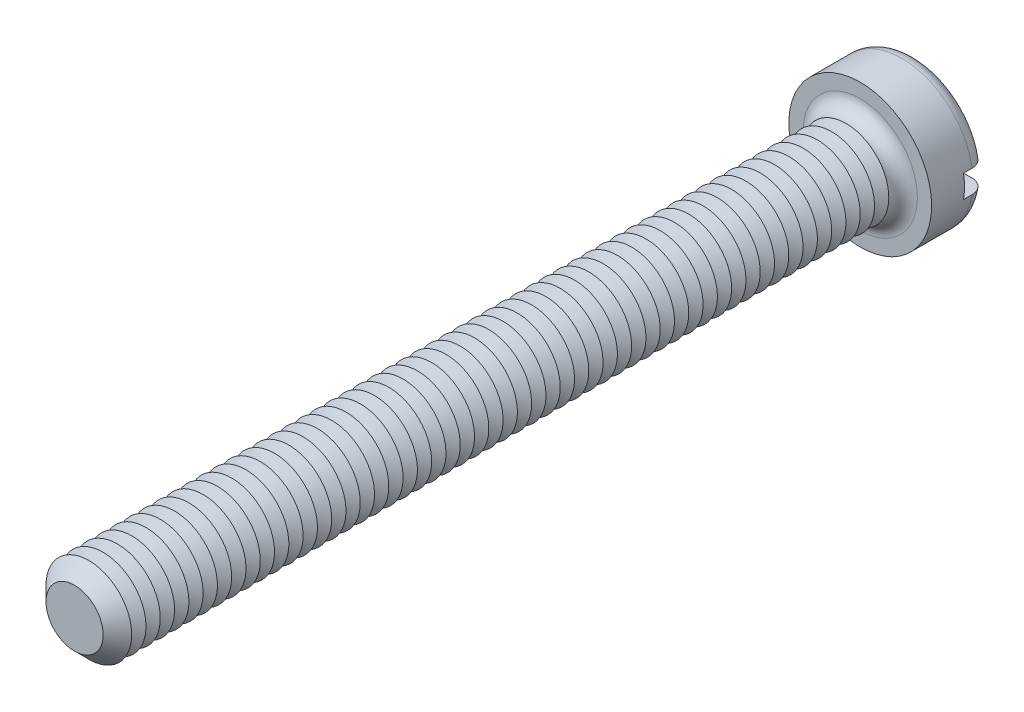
ISO-10303-21;
HEADER;
FILE_DESCRIPTION(('STEP AP214'),'2;1');
FILE_NAME('part.step','',(''),(''),'','','');
FILE_SCHEMA(('AUTOMOTIVE_DESIGN { 1 0 10303 214 1 1 1 1 }'));
ENDSEC;
DATA;
#1=APPLICATION_CONTEXT('core data for automotive mechanical design processes');
#2=APPLICATION_PROTOCOL_DEFINITION('international standard','automotive_design',2000,#1);
#3=PRODUCT_CONTEXT('',#1,'mechanical');
#4=PRODUCT('Part','Part','',(#3));
#5=PRODUCT_RELATED_PRODUCT_CATEGORY('part','',(#4));
#6=PRODUCT_DEFINITION_FORMATION('','',#4);
#7=PRODUCT_DEFINITION_CONTEXT('part definition',#1,'design');
#8=PRODUCT_DEFINITION('design','',#6,#7);
#9=PRODUCT_DEFINITION_SHAPE('','',#8);
#10=(LENGTH_UNIT() NAMED_UNIT(*) SI_UNIT(.MILLI.,.METRE.));
#11=(NAMED_UNIT(*) PLANE_ANGLE_UNIT() SI_UNIT($,.RADIAN.));
#12=(NAMED_UNIT(*) SI_UNIT($,.STERADIAN.) SOLID_ANGLE_UNIT());
#13=UNCERTAINTY_MEASURE_WITH_UNIT(LENGTH_MEASURE(1.E-05),#10,'distance_accuracy_value','');
#14=(GEOMETRIC_REPRESENTATION_CONTEXT(3) GLOBAL_UNCERTAINTY_ASSIGNED_CONTEXT((#13)) GLOBAL_UNIT_ASSIGNED_CONTEXT((#10,
#11,#12)) REPRESENTATION_CONTEXT('',''));
#15=CARTESIAN_POINT('',(0.,0.,0.));
#16=DIRECTION('',(0.,0.,1.));
#17=DIRECTION('',(1.,0.,0.));
#18=AXIS2_PLACEMENT_3D('',#15,#16,#17);
#19=CARTESIAN_POINT('',(0.,0.,-3.9));
#20=DIRECTION('',(0.,0.,1.));
#21=DIRECTION('',(1.,0.,0.));
#22=AXIS2_PLACEMENT_3D('',#19,#20,#21);
#23=PLANE('',#22);
#24=CARTESIAN_POINT('',(0.,0.,-3.9));
#25=DIRECTION('',(0.,0.,1.));
#26=DIRECTION('',(1.,0.,0.));
#27=AXIS2_PLACEMENT_3D('',#24,#25,#26);
#28=CIRCLE('',#27,4.);
#29=CARTESIAN_POINT('',(-3.91918358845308,0.800000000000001,-3.9));
#30=VERTEX_POINT('',#29);
#31=CARTESIAN_POINT('',(3.91918358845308,0.8,-3.9));
#32=VERTEX_POINT('',#31);
#33=EDGE_CURVE('E116',#30,#32,#28,.F.);
#34=ORIENTED_EDGE('',*,*,#33,.T.);
#35=DIRECTION('',(1.,0.,0.));
#36=VECTOR('',#35,1.);
#37=CARTESIAN_POINT('',(-5.,0.800000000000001,-3.9));
#38=LINE('',#37,#36);
#39=EDGE_CURVE('E111',#30,#32,#38,.T.);
#40=ORIENTED_EDGE('',*,*,#39,.F.);
#41=EDGE_LOOP('',(#34,#40));
#42=FACE_BOUND('',#41,.T.);
#43=ADVANCED_FACE('F39',(#42),#23,.F.);
#44=CARTESIAN_POINT('',(0.,0.,-2.9));
#45=DIRECTION('',(0.,0.,1.));
#46=DIRECTION('',(1.,0.,0.));
#47=AXIS2_PLACEMENT_3D('',#44,#45,#46);
#48=TOROIDAL_SURFACE('',#47,4.,1.);
#49=CARTESIAN_POINT('',(-4.76648512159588,0.800000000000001,-3.45304061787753));
#50=CARTESIAN_POINT('',(-4.73486405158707,0.800000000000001,-3.50001565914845));
#51=CARTESIAN_POINT('',(-4.69920787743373,0.800000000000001,-3.54432871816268));
#52=CARTESIAN_POINT('',(-4.62090302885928,0.800000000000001,-3.62634638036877));
#53=CARTESIAN_POINT('',(-4.57824494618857,0.800000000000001,-3.66404194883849));
#54=CARTESIAN_POINT('',(-4.48726975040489,0.800000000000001,-3.73172278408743));
#55=CARTESIAN_POINT('',(-4.43895902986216,0.800000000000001,-3.76171664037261));
#56=CARTESIAN_POINT('',(-4.33804923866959,0.800000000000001,-3.81326437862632));
#57=CARTESIAN_POINT('',(-4.2854512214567,0.800000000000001,-3.8348203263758));
#58=CARTESIAN_POINT('',(-4.17679895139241,0.800000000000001,-3.86918431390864));
#59=CARTESIAN_POINT('',(-4.12071163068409,0.800000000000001,-3.88188775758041));
#60=CARTESIAN_POINT('',(-4.00720729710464,0.800000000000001,-3.89785932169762));
#61=CARTESIAN_POINT('',(-3.94979011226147,0.800000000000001,-3.9011262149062));
#62=CARTESIAN_POINT('',(-3.83429042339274,0.800000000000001,-3.89816676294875));
#63=CARTESIAN_POINT('',(-3.77621176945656,0.800000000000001,-3.89178937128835));
#64=CARTESIAN_POINT('',(-3.66191938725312,0.800000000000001,-3.8694726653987));
#65=CARTESIAN_POINT('',(-3.60570580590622,0.800000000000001,-3.85353259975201));
#66=CARTESIAN_POINT('',(-3.49618749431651,0.800000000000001,-3.81233202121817));
#67=CARTESIAN_POINT('',(-3.44291561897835,0.800000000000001,-3.78698406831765));
#68=CARTESIAN_POINT('',(-3.34140774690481,0.800000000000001,-3.72766098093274));
#69=CARTESIAN_POINT('',(-3.29317182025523,0.800000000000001,-3.69368572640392));
#70=CARTESIAN_POINT('',(-3.20343355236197,0.800000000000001,-3.6182054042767));
#71=CARTESIAN_POINT('',(-3.16189680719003,0.800000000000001,-3.57674128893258));
#72=CARTESIAN_POINT('',(-3.08658236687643,0.800000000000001,-3.48727547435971));
#73=CARTESIAN_POINT('',(-3.05280364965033,0.800000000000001,-3.43927463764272));
#74=CARTESIAN_POINT('',(-2.99489532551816,0.800000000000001,-3.33932895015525));
#75=CARTESIAN_POINT('',(-2.97055012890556,0.800000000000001,-3.28750911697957));
#76=CARTESIAN_POINT('',(-2.93124252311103,0.800000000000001,-3.18042600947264));
#77=CARTESIAN_POINT('',(-2.91627793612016,0.800000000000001,-3.12516353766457));
#78=CARTESIAN_POINT('',(-2.89663075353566,0.800000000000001,-3.01470560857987));
#79=CARTESIAN_POINT('',(-2.89162828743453,0.800000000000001,-2.95956691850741));
#80=CARTESIAN_POINT('',(-2.89112479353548,0.800000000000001,-2.84924961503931));
#81=CARTESIAN_POINT('',(-2.89562264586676,0.800000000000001,-2.79407100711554));
#82=CARTESIAN_POINT('',(-2.91379565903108,0.800000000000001,-2.6861912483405));
#83=CARTESIAN_POINT('',(-2.92731815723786,0.800000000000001,-2.63346424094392));
#84=CARTESIAN_POINT('',(-2.96290888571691,0.800000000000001,-2.53098203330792));
#85=CARTESIAN_POINT('',(-2.98497757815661,0.800000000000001,-2.48122699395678));
#86=CARTESIAN_POINT('',(-3.03728055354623,0.800000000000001,-2.38535286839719));
#87=CARTESIAN_POINT('',(-3.06761989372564,0.800000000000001,-2.33929117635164));
#88=CARTESIAN_POINT('',(-3.13537950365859,0.800000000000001,-2.2527125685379));
#89=CARTESIAN_POINT('',(-3.17280082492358,0.800000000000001,-2.21219647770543));
#90=CARTESIAN_POINT('',(-3.2549164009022,0.800000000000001,-2.13651195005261));
#91=CARTESIAN_POINT('',(-3.29980186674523,0.800000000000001,-2.10155095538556));
#92=CARTESIAN_POINT('',(-3.39467666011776,0.800000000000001,-2.03942270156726));
#93=CARTESIAN_POINT('',(-3.44466673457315,0.800000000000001,-2.01225658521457));
#94=CARTESIAN_POINT('',(-3.5497933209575,0.800000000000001,-1.96576935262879));
#95=CARTESIAN_POINT('',(-3.60503228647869,0.800000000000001,-1.94667963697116));
#96=CARTESIAN_POINT('',(-3.71791613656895,0.800000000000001,-1.91794308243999));
#97=CARTESIAN_POINT('',(-3.77556119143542,0.800000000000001,-1.90829691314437));
#98=CARTESIAN_POINT('',(-3.89221522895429,0.800000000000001,-1.89869331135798));
#99=CARTESIAN_POINT('',(-3.9512319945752,0.800000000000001,-1.89882985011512));
#100=CARTESIAN_POINT('',(-4.06839541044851,0.800000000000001,-1.90907818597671));
#101=CARTESIAN_POINT('',(-4.12654207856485,0.800000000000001,-1.91918977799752));
#102=CARTESIAN_POINT('',(-4.23988103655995,0.800000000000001,-1.9490667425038));
#103=CARTESIAN_POINT('',(-4.29509069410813,0.800000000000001,-1.96876615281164));
#104=CARTESIAN_POINT('',(-4.40134194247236,0.800000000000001,-2.01729572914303));
#105=CARTESIAN_POINT('',(-4.45238383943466,0.800000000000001,-2.04612522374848));
#106=CARTESIAN_POINT('',(-4.54801343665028,0.800000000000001,-2.1116316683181));
#107=CARTESIAN_POINT('',(-4.59268768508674,0.800000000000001,-2.14818225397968));
#108=CARTESIAN_POINT('',(-4.67513924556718,0.800000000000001,-2.22837632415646));
#109=CARTESIAN_POINT('',(-4.71291715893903,0.800000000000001,-2.27201918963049));
#110=CARTESIAN_POINT('',(-4.77986554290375,0.800000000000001,-2.36439990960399));
#111=CARTESIAN_POINT('',(-4.80916462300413,0.800000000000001,-2.41304457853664));
#112=CARTESIAN_POINT('',(-4.85906149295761,0.800000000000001,-2.51460659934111));
#113=CARTESIAN_POINT('',(-4.8796602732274,0.800000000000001,-2.56752346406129));
#114=CARTESIAN_POINT('',(-4.9113264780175,0.800000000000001,-2.67542592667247));
#115=CARTESIAN_POINT('',(-4.92250819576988,0.800000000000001,-2.73037800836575));
#116=CARTESIAN_POINT('',(-4.93542682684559,0.800000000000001,-2.84139649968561));
#117=CARTESIAN_POINT('',(-4.93716171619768,0.800000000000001,-2.89746314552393));
#118=CARTESIAN_POINT('',(-4.93114851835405,0.800000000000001,-3.00876455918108));
#119=CARTESIAN_POINT('',(-4.92345325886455,0.800000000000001,-3.0640022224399));
#120=CARTESIAN_POINT('',(-4.8989032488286,0.800000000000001,-3.17235240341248));
#121=CARTESIAN_POINT('',(-4.88205998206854,0.800000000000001,-3.22546749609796));
#122=CARTESIAN_POINT('',(-4.84819200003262,0.800000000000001,-3.30764066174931));
#123=CARTESIAN_POINT('',(-4.83390853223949,0.800000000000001,-3.33785845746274));
#124=CARTESIAN_POINT('',(-4.80237957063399,0.800000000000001,-3.39670633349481));
#125=CARTESIAN_POINT('',(-4.78513409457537,0.800000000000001,-3.42533642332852));
#126=CARTESIAN_POINT('',(-4.76648512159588,0.800000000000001,-3.45304061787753));
#127=B_SPLINE_CURVE_WITH_KNOTS('',3,(#49,#50,#51,#52,#53,#54,#55,#56,#57,#58,#59,#60,#61,#62,
#63,#64,#65,#66,#67,#68,#69,#70,#71,#72,#73,#74,#75,#76,#77,#78,#79,#80,#81,#82,#83,#84,#85,#86,
#87,#88,#89,#90,#91,#92,#93,#94,#95,#96,#97,#98,#99,#100,#101,#102,#103,#104,#105,#106,#107,
#108,#109,#110,#111,#112,#113,#114,#115,#116,#117,#118,#119,#120,#121,#122,#123,#124,#125,#126),
.UNSPECIFIED.,.T.,.F.,(4,2,2,2,2,2,2,2,2,2,2,2,2,2,2,2,2,2,2,2,2,2,2,2,2,2,2,2,2,2,2,2,2,2,2,2,
2,2,4),(0.,0.169755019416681,0.339740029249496,0.509534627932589,0.67928763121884,
0.851013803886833,1.02276230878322,1.19722869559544,1.37170879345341,1.54785292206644,
1.72399950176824,1.89921049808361,2.07439839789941,2.24530597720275,2.41617386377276,
2.58146078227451,2.74672821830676,2.90926852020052,3.0718176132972,3.2365363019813,
3.40127946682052,3.57118676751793,3.74111896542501,3.91563534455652,4.09016409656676,
4.26636956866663,4.4425714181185,4.61757781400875,4.79257134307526,4.96489650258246,
5.13720662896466,5.30674670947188,5.47626748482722,5.64369988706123,5.81116816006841,
5.97770254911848,6.14402836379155,6.24414438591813,6.34425980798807),.UNSPECIFIED.);
#128=CARTESIAN_POINT('',(-4.93558507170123,0.800000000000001,-2.9));
#129=VERTEX_POINT('',#128);
#130=EDGE_CURVE('E602',#129,#30,#127,.T.);
#131=ORIENTED_EDGE('',*,*,#130,.F.);
#132=CARTESIAN_POINT('',(0.,0.,-2.9));
#133=DIRECTION('',(0.,0.,1.));
#134=DIRECTION('',(1.,0.,0.));
#135=AXIS2_PLACEMENT_3D('',#132,#133,#134);
#136=CIRCLE('',#135,5.);
#137=CARTESIAN_POINT('',(4.93558507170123,0.8,-2.9));
#138=VERTEX_POINT('',#137);
#139=EDGE_CURVE('E124',#138,#129,#136,.T.);
#140=ORIENTED_EDGE('',*,*,#139,.F.);
#141=CARTESIAN_POINT('',(2.98553785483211,0.8,-3.31649797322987));
#142=CARTESIAN_POINT('',(3.00991125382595,0.8,-3.36788093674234));
#143=CARTESIAN_POINT('',(3.03875556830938,0.8,-3.41719756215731));
#144=CARTESIAN_POINT('',(3.1043993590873,0.8,-3.51028676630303));
#145=CARTESIAN_POINT('',(3.1412115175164,0.8,-3.55405032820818));
#146=CARTESIAN_POINT('',(3.22153641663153,0.8,-3.63476402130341));
#147=CARTESIAN_POINT('',(3.26503706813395,0.8,-3.67172618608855));
#148=CARTESIAN_POINT('',(3.35749627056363,0.8,-3.73799476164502));
#149=CARTESIAN_POINT('',(3.4064533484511,0.8,-3.76730323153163));
#150=CARTESIAN_POINT('',(3.5095773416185,0.8,-3.81809642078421));
#151=CARTESIAN_POINT('',(3.56383317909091,0.8,-3.83940072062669));
#152=CARTESIAN_POINT('',(3.67513017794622,0.8,-3.87272481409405));
#153=CARTESIAN_POINT('',(3.7321717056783,0.8,-3.88474338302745));
#154=CARTESIAN_POINT('',(3.84815688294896,0.8,-3.89923413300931));
#155=CARTESIAN_POINT('',(3.90711516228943,0.8,-3.9015896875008));
#156=CARTESIAN_POINT('',(4.02458610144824,0.8,-3.89631753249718));
#157=CARTESIAN_POINT('',(4.08309876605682,0.8,-3.8886899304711));
#158=CARTESIAN_POINT('',(4.19768646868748,0.8,-3.86366584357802));
#159=CARTESIAN_POINT('',(4.25377243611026,0.8,-3.84631948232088));
#160=CARTESIAN_POINT('',(4.3621676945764,0.8,-3.80231797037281));
#161=CARTESIAN_POINT('',(4.41447726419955,0.8,-3.77566350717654));
#162=CARTESIAN_POINT('',(4.51300872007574,0.8,-3.71421163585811));
#163=CARTESIAN_POINT('',(4.5593085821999,0.8,-3.67953927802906));
#164=CARTESIAN_POINT('',(4.64530675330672,0.8,-3.60279495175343));
#165=CARTESIAN_POINT('',(4.68500564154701,0.8,-3.56072363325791));
#166=CARTESIAN_POINT('',(4.75599202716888,0.8,-3.47111750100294));
#167=CARTESIAN_POINT('',(4.7874061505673,0.8,-3.42368298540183));
#168=CARTESIAN_POINT('',(4.84170328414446,0.8,-3.32415927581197));
#169=CARTESIAN_POINT('',(4.86458695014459,0.8,-3.2720704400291));
#170=CARTESIAN_POINT('',(4.90088120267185,0.8,-3.16544016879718));
#171=CARTESIAN_POINT('',(4.91440984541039,0.8,-3.11093889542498));
#172=CARTESIAN_POINT('',(4.93205429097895,0.8,-3.00043391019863));
#173=CARTESIAN_POINT('',(4.93617053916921,0.8,-2.9444302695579));
#174=CARTESIAN_POINT('',(4.93486973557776,0.8,-2.83292218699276));
#175=CARTESIAN_POINT('',(4.92951827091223,0.8,-2.77741696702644));
#176=CARTESIAN_POINT('',(4.90957104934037,0.8,-2.66809456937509));
#177=CARTESIAN_POINT('',(4.89497541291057,0.8,-2.61427736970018));
#178=CARTESIAN_POINT('',(4.85697876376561,0.8,-2.50985095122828));
#179=CARTESIAN_POINT('',(4.83357805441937,0.8,-2.45924162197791));
#180=CARTESIAN_POINT('',(4.77866660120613,0.8,-2.36263484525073));
#181=CARTESIAN_POINT('',(4.74715567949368,0.8,-2.31663749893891));
#182=CARTESIAN_POINT('',(4.67670791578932,0.8,-2.23021464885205));
#183=CARTESIAN_POINT('',(4.6377224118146,0.8,-2.1898288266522));
#184=CARTESIAN_POINT('',(4.55359880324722,0.8,-2.11607828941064));
#185=CARTESIAN_POINT('',(4.50846036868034,0.8,-2.08271395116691));
#186=CARTESIAN_POINT('',(4.41271544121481,0.8,-2.02349513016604));
#187=CARTESIAN_POINT('',(4.36204749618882,0.8,-1.99774003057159));
#188=CARTESIAN_POINT('',(4.257155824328,0.8,-1.95495040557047));
#189=CARTESIAN_POINT('',(4.20293181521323,0.8,-1.93791657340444));
#190=CARTESIAN_POINT('',(4.09154156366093,0.8,-1.91276335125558));
#191=CARTESIAN_POINT('',(4.03434212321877,0.8,-1.90479098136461));
#192=CARTESIAN_POINT('',(3.91941228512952,0.8,-1.89840884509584));
#193=CARTESIAN_POINT('',(3.8616818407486,0.8,-1.89999992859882));
#194=CARTESIAN_POINT('',(3.7464111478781,0.8,-1.91275144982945));
#195=CARTESIAN_POINT('',(3.6888866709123,0.8,-1.92405471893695));
#196=CARTESIAN_POINT('',(3.57652290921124,0.8,-1.95609086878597));
#197=CARTESIAN_POINT('',(3.52168382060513,0.8,-1.97682443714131));
#198=CARTESIAN_POINT('',(3.41589179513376,0.8,-2.02733294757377));
#199=CARTESIAN_POINT('',(3.36496676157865,0.8,-2.05716640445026));
#200=CARTESIAN_POINT('',(3.26890903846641,0.8,-2.12504079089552));
#201=CARTESIAN_POINT('',(3.22377627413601,0.8,-2.16308161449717));
#202=CARTESIAN_POINT('',(3.141135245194,0.8,-2.24593284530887));
#203=CARTESIAN_POINT('',(3.1035541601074,0.8,-2.29067053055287));
#204=CARTESIAN_POINT('',(3.03669700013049,0.8,-2.38597317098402));
#205=CARTESIAN_POINT('',(3.00741914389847,0.8,-2.43653687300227));
#206=CARTESIAN_POINT('',(2.95891799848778,0.8,-2.54052959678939));
#207=CARTESIAN_POINT('',(2.93943249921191,0.8,-2.59383627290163));
#208=CARTESIAN_POINT('',(2.9100081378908,0.8,-2.70303736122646));
#209=CARTESIAN_POINT('',(2.90006970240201,0.8,-2.75893188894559));
#210=CARTESIAN_POINT('',(2.89027863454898,0.8,-2.86986958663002));
#211=CARTESIAN_POINT('',(2.89012791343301,0.8,-2.92488680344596));
#212=CARTESIAN_POINT('',(2.89917145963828,0.8,-3.03409648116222));
#213=CARTESIAN_POINT('',(2.90835313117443,0.8,-3.08828995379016));
#214=CARTESIAN_POINT('',(2.92977618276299,0.8,-3.17141652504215));
#215=CARTESIAN_POINT('',(2.93899011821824,0.8,-3.20116372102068));
#216=CARTESIAN_POINT('',(2.96020249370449,0.8,-3.25964614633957));
#217=CARTESIAN_POINT('',(2.97220082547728,0.8,-3.28838141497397));
#218=CARTESIAN_POINT('',(2.98553785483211,0.8,-3.31649797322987));
#219=B_SPLINE_CURVE_WITH_KNOTS('',3,(#141,#142,#143,#144,#145,#146,#147,#148,#149,#150,#151,
#152,#153,#154,#155,#156,#157,#158,#159,#160,#161,#162,#163,#164,#165,#166,#167,#168,#169,#170,
#171,#172,#173,#174,#175,#176,#177,#178,#179,#180,#181,#182,#183,#184,#185,#186,#187,#188,#189,
#190,#191,#192,#193,#194,#195,#196,#197,#198,#199,#200,#201,#202,#203,#204,#205,#206,#207,#208,
#209,#210,#211,#212,#213,#214,#215,#216,#217,#218),.UNSPECIFIED.,.T.,.F.,(4,2,2,2,2,2,2,2,2,2,2,
2,2,2,2,2,2,2,2,2,2,2,2,2,2,2,2,2,2,2,2,2,2,2,2,2,2,2,4),(0.,0.170493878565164,
0.341261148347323,0.511723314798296,0.682139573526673,0.856194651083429,1.03027268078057,
1.20644565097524,1.38261672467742,1.55788746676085,1.73314526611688,1.90583484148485,
2.07850925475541,2.24836742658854,2.41821253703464,2.58587311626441,2.75352576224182,
2.92002154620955,3.08651516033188,3.25300303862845,3.41949456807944,3.58710926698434,
3.75473295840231,3.92445790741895,4.09419634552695,4.26665110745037,4.43912119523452,
4.61417197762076,4.78923552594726,4.96544940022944,5.1416609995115,5.31608191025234,
5.49046537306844,5.65989063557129,5.82932346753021,5.99359365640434,6.157642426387,
6.250939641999,6.34423323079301),.UNSPECIFIED.);
#220=EDGE_CURVE('E604',#32,#138,#219,.T.);
#221=ORIENTED_EDGE('',*,*,#220,.F.);
#222=ORIENTED_EDGE('',*,*,#33,.F.);
#223=EDGE_LOOP('',(#131,#140,#221,#222));
#224=FACE_BOUND('',#223,.T.);
#225=ADVANCED_FACE('F586',(#224),#48,.T.);
#226=CARTESIAN_POINT('',(0.,0.,-3.9));
#227=DIRECTION('',(0.,0.,1.));
#228=DIRECTION('',(1.,0.,0.));
#229=AXIS2_PLACEMENT_3D('',#226,#227,#228);
#230=CYLINDRICAL_SURFACE('',#229,5.);
#231=DIRECTION('',(0.,0.,1.));
#232=VECTOR('',#231,1.);
#233=CARTESIAN_POINT('',(4.93558507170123,0.8,-3.9));
#234=LINE('',#233,#232);
#235=CARTESIAN_POINT('',(4.93558507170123,0.8,-2.3));
#236=VERTEX_POINT('',#235);
#237=EDGE_CURVE('E618',#138,#236,#234,.T.);
#238=ORIENTED_EDGE('',*,*,#237,.F.);
#239=ORIENTED_EDGE('',*,*,#139,.T.);
#240=DIRECTION('',(0.,0.,1.));
#241=VECTOR('',#240,1.);
#242=CARTESIAN_POINT('',(-4.93558507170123,0.800000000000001,-3.9));
#243=LINE('',#242,#241);
#244=CARTESIAN_POINT('',(-4.93558507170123,0.800000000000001,-2.3));
#245=VERTEX_POINT('',#244);
#246=EDGE_CURVE('E63',#245,#129,#243,.F.);
#247=ORIENTED_EDGE('',*,*,#246,.F.);
#248=CARTESIAN_POINT('',(0.,0.,-2.3));
#249=DIRECTION('',(0.,0.,-1.));
#250=DIRECTION('',(-1.,0.,0.));
#251=AXIS2_PLACEMENT_3D('',#248,#249,#250);
#252=CIRCLE('',#251,5.);
#253=CARTESIAN_POINT('',(-4.93558507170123,-0.799999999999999,-2.3));
#254=VERTEX_POINT('',#253);
#255=EDGE_CURVE('E43',#245,#254,#252,.F.);
#256=ORIENTED_EDGE('',*,*,#255,.T.);
#257=DIRECTION('',(0.,0.,1.));
#258=VECTOR('',#257,1.);
#259=CARTESIAN_POINT('',(-4.93558507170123,-0.799999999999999,-3.9));
#260=LINE('',#259,#258);
#261=CARTESIAN_POINT('',(-4.93558507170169,-0.799999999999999,-2.89999999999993));
#262=VERTEX_POINT('',#261);
#263=EDGE_CURVE('E615',#262,#254,#260,.T.);
#264=ORIENTED_EDGE('',*,*,#263,.F.);
#265=CARTESIAN_POINT('',(4.93558507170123,-0.8,-2.9));
#266=VERTEX_POINT('',#265);
#267=EDGE_CURVE('E126',#262,#266,#136,.T.);
#268=ORIENTED_EDGE('',*,*,#267,.T.);
#269=DIRECTION('',(0.,0.,1.));
#270=VECTOR('',#269,1.);
#271=CARTESIAN_POINT('',(4.93558507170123,-0.8,-3.9));
#272=LINE('',#271,#270);
#273=CARTESIAN_POINT('',(4.93558507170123,-0.8,-2.3));
#274=VERTEX_POINT('',#273);
#275=EDGE_CURVE('E55',#274,#266,#272,.F.);
#276=ORIENTED_EDGE('',*,*,#275,.F.);
#277=EDGE_CURVE('E11',#274,#236,#252,.F.);
#278=ORIENTED_EDGE('',*,*,#277,.T.);
#279=EDGE_LOOP('',(#238,#239,#247,#256,#264,#268,#276,#278));
#280=FACE_BOUND('',#279,.T.);
#281=CARTESIAN_POINT('',(0.,0.,0.));
#282=DIRECTION('',(0.,0.,1.));
#283=DIRECTION('',(1.,0.,0.));
#284=AXIS2_PLACEMENT_3D('',#281,#282,#283);
#285=CIRCLE('',#284,5.);
#286=CARTESIAN_POINT('',(5.,0.,0.));
#287=VERTEX_POINT('',#286);
#288=EDGE_CURVE('E621',#287,#287,#285,.T.);
#289=ORIENTED_EDGE('',*,*,#288,.F.);
#290=EDGE_LOOP('',(#289));
#291=FACE_BOUND('',#290,.T.);
#292=ADVANCED_FACE('F582',(#280,#291),#230,.T.);
#293=CARTESIAN_POINT('',(3.91918358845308,-0.8,-3.9));
#294=VERTEX_POINT('',#293);
#295=CARTESIAN_POINT('',(-3.91918358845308,-0.799999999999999,-3.9));
#296=VERTEX_POINT('',#295);
#297=EDGE_CURVE('E109',#294,#296,#28,.F.);
#298=ORIENTED_EDGE('',*,*,#297,.T.);
#299=DIRECTION('',(-1.,0.,0.));
#300=VECTOR('',#299,1.);
#301=CARTESIAN_POINT('',(-5.,-0.799999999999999,-3.9));
#302=LINE('',#301,#300);
#303=EDGE_CURVE('E96',#294,#296,#302,.T.);
#304=ORIENTED_EDGE('',*,*,#303,.F.);
#305=EDGE_LOOP('',(#298,#304));
#306=FACE_BOUND('',#305,.T.);
#307=ADVANCED_FACE('F108',(#306),#23,.F.);
#308=CARTESIAN_POINT('',(0.,0.,0.));
#309=DIRECTION('',(0.,0.,1.));
#310=DIRECTION('',(1.,0.,0.));
#311=AXIS2_PLACEMENT_3D('',#308,#309,#310);
#312=PLANE('',#311);
#313=CARTESIAN_POINT('',(0.,0.,0.));
#314=DIRECTION('',(0.,0.,1.));
#315=DIRECTION('',(1.,0.,0.));
#316=AXIS2_PLACEMENT_3D('',#313,#314,#315);
#317=CIRCLE('',#316,4.);
#318=CARTESIAN_POINT('',(4.,0.,0.));
#319=VERTEX_POINT('',#318);
#320=EDGE_CURVE('E115',#319,#319,#317,.F.);
#321=ORIENTED_EDGE('',*,*,#320,.T.);
#322=EDGE_LOOP('',(#321));
#323=FACE_BOUND('',#322,.T.);
#324=ORIENTED_EDGE('',*,*,#288,.T.);
#325=EDGE_LOOP('',(#324));
#326=FACE_BOUND('',#325,.T.);
#327=ADVANCED_FACE('F581',(#323,#326),#312,.T.);
#328=CARTESIAN_POINT('',(-4.76648512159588,-0.799999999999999,-3.45304061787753));
#329=CARTESIAN_POINT('',(-4.7975694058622,-0.799999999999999,-3.40685392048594));
#330=CARTESIAN_POINT('',(-4.82479903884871,-0.799999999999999,-3.35802740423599));
#331=CARTESIAN_POINT('',(-4.87070632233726,-0.799999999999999,-3.25646127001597));
#332=CARTESIAN_POINT('',(-4.8893747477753,-0.799999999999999,-3.20371750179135));
#333=CARTESIAN_POINT('',(-4.91756720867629,-0.799999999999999,-3.09584501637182));
#334=CARTESIAN_POINT('',(-4.92709302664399,-0.799999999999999,-3.04071676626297));
#335=CARTESIAN_POINT('',(-4.93671217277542,-0.799999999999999,-2.92965669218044));
#336=CARTESIAN_POINT('',(-4.93680767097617,-0.799999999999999,-2.87372505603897));
#337=CARTESIAN_POINT('',(-4.92758675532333,-0.799999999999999,-2.76284675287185));
#338=CARTESIAN_POINT('',(-4.91830421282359,-0.799999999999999,-2.70789726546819));
#339=CARTESIAN_POINT('',(-4.89065741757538,-0.799999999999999,-2.60033228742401));
#340=CARTESIAN_POINT('',(-4.87229291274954,-0.799999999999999,-2.54771686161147));
#341=CARTESIAN_POINT('',(-4.82699855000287,-0.799999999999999,-2.44622441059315));
#342=CARTESIAN_POINT('',(-4.80005659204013,-0.799999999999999,-2.39735278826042));
#343=CARTESIAN_POINT('',(-4.73841244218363,-0.799999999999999,-2.30477947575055));
#344=CARTESIAN_POINT('',(-4.70371003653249,-0.799999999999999,-2.26107792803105));
#345=CARTESIAN_POINT('',(-4.62724516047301,-0.799999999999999,-2.17969334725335));
#346=CARTESIAN_POINT('',(-4.58542787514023,-0.799999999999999,-2.14206183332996));
#347=CARTESIAN_POINT('',(-4.49614171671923,-0.799999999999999,-2.07424284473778));
#348=CARTESIAN_POINT('',(-4.44867251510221,-0.799999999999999,-2.04405580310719));
#349=CARTESIAN_POINT('',(-4.34875035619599,-0.799999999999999,-1.99153688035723));
#350=CARTESIAN_POINT('',(-4.29623870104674,-0.799999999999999,-1.96931670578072));
#351=CARTESIAN_POINT('',(-4.18826905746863,-0.799999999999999,-1.93384994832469));
#352=CARTESIAN_POINT('',(-4.1328108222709,-0.799999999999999,-1.92060411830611));
#353=CARTESIAN_POINT('',(-4.01956054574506,-0.799999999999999,-1.90323798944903));
#354=CARTESIAN_POINT('',(-3.96174522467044,-0.799999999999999,-1.89926947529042));
#355=CARTESIAN_POINT('',(-3.84625419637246,-0.799999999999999,-1.90095183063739));
#356=CARTESIAN_POINT('',(-3.78857850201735,-0.799999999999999,-1.90660355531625));
#357=CARTESIAN_POINT('',(-3.67415602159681,-0.799999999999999,-1.92748272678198));
#358=CARTESIAN_POINT('',(-3.61743328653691,-0.799999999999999,-1.94284216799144));
#359=CARTESIAN_POINT('',(-3.50734962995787,-0.799999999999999,-1.9828275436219));
#360=CARTESIAN_POINT('',(-3.4539889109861,-0.799999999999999,-2.00745403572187));
#361=CARTESIAN_POINT('',(-3.35197118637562,-0.799999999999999,-2.06542964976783));
#362=CARTESIAN_POINT('',(-3.30333217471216,-0.799999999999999,-2.0988104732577));
#363=CARTESIAN_POINT('',(-3.21244692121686,-0.799999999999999,-2.17337326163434));
#364=CARTESIAN_POINT('',(-3.17020039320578,-0.799999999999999,-2.21455487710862));
#365=CARTESIAN_POINT('',(-3.0940098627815,-0.799999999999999,-2.30296695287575));
#366=CARTESIAN_POINT('',(-3.05995540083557,-0.799999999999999,-2.35010211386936));
#367=CARTESIAN_POINT('',(-3.00053815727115,-0.799999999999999,-2.4495670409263));
#368=CARTESIAN_POINT('',(-2.97517362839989,-0.799999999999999,-2.50189576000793));
#369=CARTESIAN_POINT('',(-2.93470320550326,-0.799999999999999,-2.60853979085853));
#370=CARTESIAN_POINT('',(-2.91930557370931,-0.799999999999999,-2.66274437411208));
#371=CARTESIAN_POINT('',(-2.89812734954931,-0.799999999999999,-2.77299836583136));
#372=CARTESIAN_POINT('',(-2.89234481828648,-0.799999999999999,-2.82904740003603));
#373=CARTESIAN_POINT('',(-2.89064073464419,-0.799999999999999,-2.93970612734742));
#374=CARTESIAN_POINT('',(-2.89444549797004,-0.799999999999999,-2.99431180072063));
#375=CARTESIAN_POINT('',(-2.9112006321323,-0.799999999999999,-3.10209766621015));
#376=CARTESIAN_POINT('',(-2.9241507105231,-0.799999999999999,-3.1552779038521));
#377=CARTESIAN_POINT('',(-2.95868580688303,-0.799999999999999,-3.25858631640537));
#378=CARTESIAN_POINT('',(-2.98024709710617,-0.799999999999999,-3.30872244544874));
#379=CARTESIAN_POINT('',(-3.03128544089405,-0.799999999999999,-3.40478519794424));
#380=CARTESIAN_POINT('',(-3.06076335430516,-0.799999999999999,-3.45071136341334));
#381=CARTESIAN_POINT('',(-3.12753448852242,-0.799999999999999,-3.53826932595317));
#382=CARTESIAN_POINT('',(-3.16500083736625,-0.799999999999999,-3.57976901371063));
#383=CARTESIAN_POINT('',(-3.24617503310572,-0.799999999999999,-3.65613204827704));
#384=CARTESIAN_POINT('',(-3.28988388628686,-0.799999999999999,-3.69099432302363));
#385=CARTESIAN_POINT('',(-3.38380639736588,-0.799999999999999,-3.75424083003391));
#386=CARTESIAN_POINT('',(-3.43418287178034,-0.799999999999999,-3.78238342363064));
#387=CARTESIAN_POINT('',(-3.53887888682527,-0.799999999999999,-3.83000231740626));
#388=CARTESIAN_POINT('',(-3.59319889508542,-0.799999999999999,-3.84947758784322));
#389=CARTESIAN_POINT('',(-3.70539237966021,-0.799999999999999,-3.87954336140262));
#390=CARTESIAN_POINT('',(-3.76331464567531,-0.799999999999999,-3.88995217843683));
#391=CARTESIAN_POINT('',(-3.88008461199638,-0.799999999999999,-3.9009132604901));
#392=CARTESIAN_POINT('',(-3.93893230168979,-0.799999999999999,-3.9014656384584));
#393=CARTESIAN_POINT('',(-4.05594892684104,-0.799999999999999,-3.89264187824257));
#394=CARTESIAN_POINT('',(-4.11411702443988,-0.799999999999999,-3.88325457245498));
#395=CARTESIAN_POINT('',(-4.22802928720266,-0.799999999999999,-3.85472582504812));
#396=CARTESIAN_POINT('',(-4.28377297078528,-0.799999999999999,-3.83558245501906));
#397=CARTESIAN_POINT('',(-4.39054463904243,-0.799999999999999,-3.78829842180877));
#398=CARTESIAN_POINT('',(-4.44161887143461,-0.799999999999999,-3.76026208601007));
#399=CARTESIAN_POINT('',(-4.53818016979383,-0.799999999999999,-3.69589278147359));
#400=CARTESIAN_POINT('',(-4.58367442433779,-0.799999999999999,-3.65957066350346));
#401=CARTESIAN_POINT('',(-4.65208830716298,-0.799999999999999,-3.59453310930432));
#402=CARTESIAN_POINT('',(-4.67711825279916,-0.799999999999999,-3.56800018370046));
#403=CARTESIAN_POINT('',(-4.72414423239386,-0.799999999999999,-3.51236863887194));
#404=CARTESIAN_POINT('',(-4.74614029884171,-0.799999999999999,-3.48327004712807));
#405=CARTESIAN_POINT('',(-4.76648512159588,-0.799999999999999,-3.45304061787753));
#406=B_SPLINE_CURVE_WITH_KNOTS('',3,(#328,#329,#330,#331,#332,#333,#334,#335,#336,#337,#338,
#339,#340,#341,#342,#343,#344,#345,#346,#347,#348,#349,#350,#351,#352,#353,#354,#355,#356,#357,
#358,#359,#360,#361,#362,#363,#364,#365,#366,#367,#368,#369,#370,#371,#372,#373,#374,#375,#376,
#377,#378,#379,#380,#381,#382,#383,#384,#385,#386,#387,#388,#389,#390,#391,#392,#393,#394,#395,
#396,#397,#398,#399,#400,#401,#402,#403,#404,#405),.UNSPECIFIED.,.T.,.F.,(4,2,2,2,2,2,2,2,2,2,2,
2,2,2,2,2,2,2,2,2,2,2,2,2,2,2,2,2,2,2,2,2,2,2,2,2,2,2,4),(0.,0.166886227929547,
0.333951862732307,0.500984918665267,0.667979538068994,0.834373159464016,1.00077139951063,
1.16740542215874,1.33404403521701,1.50202999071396,1.67002571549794,1.84029248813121,
2.01057354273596,2.18362161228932,2.35668506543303,2.53215380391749,2.70763310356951,
2.88375684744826,3.05987270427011,3.23346085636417,3.40701408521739,3.57522519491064,
3.74340238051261,3.90683338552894,4.0702591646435,4.23323770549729,4.39623395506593,
4.56320691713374,4.7302068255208,4.90252468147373,5.07486300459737,5.25058028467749,
5.42629555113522,5.60220844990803,5.77815613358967,5.95211162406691,6.12584060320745,
6.23506966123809,6.34429754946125),.UNSPECIFIED.);
#407=EDGE_CURVE('E103',#296,#262,#406,.T.);
#408=ORIENTED_EDGE('',*,*,#407,.F.);
#409=ORIENTED_EDGE('',*,*,#297,.F.);
#410=CARTESIAN_POINT('',(2.98553785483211,-0.8,-3.31649797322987));
#411=CARTESIAN_POINT('',(2.96216773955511,-0.8,-3.26721849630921));
#412=CARTESIAN_POINT('',(2.94287503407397,-0.8,-3.21596872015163));
#413=CARTESIAN_POINT('',(2.91313258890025,-0.8,-3.11092723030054));
#414=CARTESIAN_POINT('',(2.9026902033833,-0.8,-3.0571334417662));
#415=CARTESIAN_POINT('',(2.89104377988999,-0.8,-2.94853922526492));
#416=CARTESIAN_POINT('',(2.88984130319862,-0.8,-2.89373862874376));
#417=CARTESIAN_POINT('',(2.89672585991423,-0.8,-2.78473646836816));
#418=CARTESIAN_POINT('',(2.90481120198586,-0.8,-2.73053479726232));
#419=CARTESIAN_POINT('',(2.92989134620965,-0.8,-2.62460092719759));
#420=CARTESIAN_POINT('',(2.94682969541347,-0.8,-2.57285532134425));
#421=CARTESIAN_POINT('',(2.9889990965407,-0.8,-2.47286425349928));
#422=CARTESIAN_POINT('',(3.01423103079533,-0.8,-2.42461916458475));
#423=CARTESIAN_POINT('',(3.07271536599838,-0.8,-2.33201565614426));
#424=CARTESIAN_POINT('',(3.10610710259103,-0.8,-2.28774532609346));
#425=CARTESIAN_POINT('',(3.17963417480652,-0.8,-2.205215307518));
#426=CARTESIAN_POINT('',(3.21977054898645,-0.8,-2.16695654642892));
#427=CARTESIAN_POINT('',(3.3070361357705,-0.8,-2.09624274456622));
#428=CARTESIAN_POINT('',(3.35434874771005,-0.8,-2.06401396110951));
#429=CARTESIAN_POINT('',(3.45361131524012,-0.8,-2.00773436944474));
#430=CARTESIAN_POINT('',(3.50556189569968,-0.8,-1.98368466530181));
#431=CARTESIAN_POINT('',(3.61398433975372,-0.8,-1.94389460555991));
#432=CARTESIAN_POINT('',(3.67053506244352,-0.8,-1.92836880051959));
#433=CARTESIAN_POINT('',(3.78543606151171,-0.8,-1.90696594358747));
#434=CARTESIAN_POINT('',(3.84378643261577,-0.8,-1.90108940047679));
#435=CARTESIAN_POINT('',(3.96100201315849,-0.8,-1.89918115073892));
#436=CARTESIAN_POINT('',(4.01986821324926,-0.8,-1.90320860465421));
#437=CARTESIAN_POINT('',(4.13606891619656,-0.8,-1.9211820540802));
#438=CARTESIAN_POINT('',(4.19340347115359,-0.8,-1.93512771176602));
#439=CARTESIAN_POINT('',(4.30434213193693,-0.8,-1.97243705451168));
#440=CARTESIAN_POINT('',(4.35797549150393,-0.8,-1.99571368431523));
#441=CARTESIAN_POINT('',(4.46048254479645,-0.8,-2.0510826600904));
#442=CARTESIAN_POINT('',(4.50935662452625,-0.8,-2.08317429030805));
#443=CARTESIAN_POINT('',(4.60012348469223,-0.8,-2.15471647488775));
#444=CARTESIAN_POINT('',(4.64211506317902,-0.8,-2.19404167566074));
#445=CARTESIAN_POINT('',(4.71877054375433,-0.8,-2.27928299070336));
#446=CARTESIAN_POINT('',(4.75343508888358,-0.8,-2.32519852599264));
#447=CARTESIAN_POINT('',(4.81388799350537,-0.8,-2.4215411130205));
#448=CARTESIAN_POINT('',(4.83980652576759,-0.8,-2.47188650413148));
#449=CARTESIAN_POINT('',(4.88271402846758,-0.8,-2.57624865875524));
#450=CARTESIAN_POINT('',(4.89970360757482,-0.8,-2.63026517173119));
#451=CARTESIAN_POINT('',(4.92409334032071,-0.8,-2.73978844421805));
#452=CARTESIAN_POINT('',(4.93159814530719,-0.8,-2.79527191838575));
#453=CARTESIAN_POINT('',(4.93713723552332,-0.8,-2.90670881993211));
#454=CARTESIAN_POINT('',(4.9351718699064,-0.8,-2.9626622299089));
#455=CARTESIAN_POINT('',(4.92186293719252,-0.8,-3.07317093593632));
#456=CARTESIAN_POINT('',(4.91056393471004,-0.8,-3.12773160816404));
#457=CARTESIAN_POINT('',(4.87898532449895,-0.8,-3.234187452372));
#458=CARTESIAN_POINT('',(4.85870572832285,-0.8,-3.28608262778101));
#459=CARTESIAN_POINT('',(4.80971634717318,-0.8,-3.38586723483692));
#460=CARTESIAN_POINT('',(4.78098824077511,-0.8,-3.43374766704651));
#461=CARTESIAN_POINT('',(4.71596686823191,-0.8,-3.52405937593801));
#462=CARTESIAN_POINT('',(4.67967336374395,-0.8,-3.56649048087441));
#463=CARTESIAN_POINT('',(4.60022577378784,-0.8,-3.64511036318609));
#464=CARTESIAN_POINT('',(4.5570143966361,-0.8,-3.6812412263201));
#465=CARTESIAN_POINT('',(4.4652099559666,-0.8,-3.7458530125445));
#466=CARTESIAN_POINT('',(4.41661654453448,-0.8,-3.77433344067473));
#467=CARTESIAN_POINT('',(4.31470683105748,-0.8,-3.82326981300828));
#468=CARTESIAN_POINT('',(4.26133399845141,-0.8,-3.84360800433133));
#469=CARTESIAN_POINT('',(4.15196444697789,-0.8,-3.87519515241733));
#470=CARTESIAN_POINT('',(4.09596750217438,-0.8,-3.88644332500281));
#471=CARTESIAN_POINT('',(3.98196469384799,-0.8,-3.89971870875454));
#472=CARTESIAN_POINT('',(3.92394096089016,-0.8,-3.901592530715));
#473=CARTESIAN_POINT('',(3.8083852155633,-0.8,-3.89570840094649));
#474=CARTESIAN_POINT('',(3.75085322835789,-0.8,-3.88794995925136));
#475=CARTESIAN_POINT('',(3.6371167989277,-0.8,-3.86287824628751));
#476=CARTESIAN_POINT('',(3.58093962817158,-0.8,-3.84544111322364));
#477=CARTESIAN_POINT('',(3.47227948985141,-0.8,-3.80139971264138));
#478=CARTESIAN_POINT('',(3.41979762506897,-0.8,-3.77479272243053));
#479=CARTESIAN_POINT('',(3.31994061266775,-0.8,-3.71304199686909));
#480=CARTESIAN_POINT('',(3.27257854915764,-0.8,-3.67787710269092));
#481=CARTESIAN_POINT('',(3.18459619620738,-0.8,-3.59999704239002));
#482=CARTESIAN_POINT('',(3.14396747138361,-0.8,-3.55729146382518));
#483=CARTESIAN_POINT('',(3.08341110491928,-0.8,-3.48140072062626));
#484=CARTESIAN_POINT('',(3.06118126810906,-0.8,-3.45002448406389));
#485=CARTESIAN_POINT('',(3.02047302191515,-0.8,-3.38492378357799));
#486=CARTESIAN_POINT('',(3.00199451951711,-0.8,-3.35119937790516));
#487=CARTESIAN_POINT('',(2.98553785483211,-0.8,-3.31649797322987));
#488=B_SPLINE_CURVE_WITH_KNOTS('',3,(#410,#411,#412,#413,#414,#415,#416,#417,#418,#419,#420,
#421,#422,#423,#424,#425,#426,#427,#428,#429,#430,#431,#432,#433,#434,#435,#436,#437,#438,#439,
#440,#441,#442,#443,#444,#445,#446,#447,#448,#449,#450,#451,#452,#453,#454,#455,#456,#457,#458,
#459,#460,#461,#462,#463,#464,#465,#466,#467,#468,#469,#470,#471,#472,#473,#474,#475,#476,#477,
#478,#479,#480,#481,#482,#483,#484,#485,#486,#487),.UNSPECIFIED.,.T.,.F.,(4,2,2,2,2,2,2,2,2,2,2,
2,2,2,2,2,2,2,2,2,2,2,2,2,2,2,2,2,2,2,2,2,2,2,2,2,2,2,4),(0.,0.163484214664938,
0.327104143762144,0.490751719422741,0.654369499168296,0.816956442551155,0.979560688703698,
1.14516376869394,1.31079237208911,1.48174839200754,1.6527274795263,1.82783306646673,
2.00294788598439,2.17911127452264,2.35526866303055,2.52981944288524,2.70435605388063,
2.87611266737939,3.04785420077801,3.21691347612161,3.38596122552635,3.55312700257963,
3.72028661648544,3.88665268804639,4.053018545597,4.2197478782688,4.38648246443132,
4.55467705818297,4.72288253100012,4.89343959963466,5.06401138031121,5.23736524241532,
5.41072792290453,5.58636211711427,5.76204850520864,5.93817375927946,6.11407667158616,
6.22920111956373,6.34432271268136),.UNSPECIFIED.);
#489=EDGE_CURVE('E92',#266,#294,#488,.T.);
#490=ORIENTED_EDGE('',*,*,#489,.F.);
#491=ORIENTED_EDGE('',*,*,#267,.F.);
#492=EDGE_LOOP('',(#408,#409,#490,#491));
#493=FACE_BOUND('',#492,.T.);
#494=ADVANCED_FACE('F113',(#493),#48,.T.);
#495=CARTESIAN_POINT('',(0.,0.,1.));
#496=DIRECTION('',(0.,0.,1.));
#497=DIRECTION('',(1.,0.,0.));
#498=AXIS2_PLACEMENT_3D('',#495,#496,#497);
#499=TOROIDAL_SURFACE('',#498,4.,1.);
#500=ORIENTED_EDGE('',*,*,#320,.F.);
#501=EDGE_LOOP('',(#500));
#502=FACE_BOUND('',#501,.T.);
#503=CARTESIAN_POINT('',(0.,0.,1.));
#504=DIRECTION('',(0.,0.,-1.));
#505=DIRECTION('',(-1.,0.,0.));
#506=AXIS2_PLACEMENT_3D('',#503,#504,#505);
#507=CIRCLE('',#506,3.);
#508=CARTESIAN_POINT('',(-3.,0.,1.));
#509=VERTEX_POINT('',#508);
#510=EDGE_CURVE('E627',#509,#509,#507,.T.);
#511=ORIENTED_EDGE('',*,*,#510,.T.);
#512=EDGE_LOOP('',(#511));
#513=FACE_BOUND('',#512,.T.);
#514=ADVANCED_FACE('F574',(#502,#513),#499,.F.);
#515=CARTESIAN_POINT('',(0.,0.,1.5));
#516=DIRECTION('',(0.,0.,-1.));
#517=DIRECTION('',(-1.,0.,0.));
#518=AXIS2_PLACEMENT_3D('',#515,#516,#517);
#519=CONICAL_SURFACE('',#518,2.13397459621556,1.0471975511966);
#520=ORIENTED_EDGE('',*,*,#510,.F.);
#521=EDGE_LOOP('',(#520));
#522=FACE_BOUND('',#521,.T.);
#523=CARTESIAN_POINT('',(0.,0.,1.5));
#524=DIRECTION('',(0.,0.,-1.));
#525=DIRECTION('',(-1.,0.,0.));
#526=AXIS2_PLACEMENT_3D('',#523,#524,#525);
#527=CIRCLE('',#526,2.13397459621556);
#528=CARTESIAN_POINT('',(-2.13397459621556,0.,1.5));
#529=VERTEX_POINT('',#528);
#530=EDGE_CURVE('E634',#529,#529,#527,.T.);
#531=ORIENTED_EDGE('',*,*,#530,.T.);
#532=EDGE_LOOP('',(#531));
#533=FACE_BOUND('',#532,.T.);
#534=ADVANCED_FACE('F570',(#522,#533),#519,.T.);
#535=CARTESIAN_POINT('',(0.,0.,2.));
#536=DIRECTION('',(0.,0.,1.));
#537=DIRECTION('',(1.,0.,0.));
#538=AXIS2_PLACEMENT_3D('',#535,#536,#537);
#539=CONICAL_SURFACE('',#538,3.,1.0471975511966);
#540=ORIENTED_EDGE('',*,*,#530,.F.);
#541=EDGE_LOOP('',(#540));
#542=FACE_BOUND('',#541,.T.);
#543=CARTESIAN_POINT('',(0.,0.,2.));
#544=DIRECTION('',(0.,0.,-1.));
#545=DIRECTION('',(-1.,0.,0.));
#546=AXIS2_PLACEMENT_3D('',#543,#544,#545);
#547=CIRCLE('',#546,3.);
#548=CARTESIAN_POINT('',(-3.,0.,2.));
#549=VERTEX_POINT('',#548);
#550=EDGE_CURVE('E640',#549,#549,#547,.T.);
#551=ORIENTED_EDGE('',*,*,#550,.T.);
#552=EDGE_LOOP('',(#551));
#553=FACE_BOUND('',#552,.T.);
#554=ADVANCED_FACE('F566',(#542,#553),#539,.T.);
#555=CARTESIAN_POINT('',(0.,0.,2.5));
#556=DIRECTION('',(0.,0.,-1.));
#557=DIRECTION('',(-1.,0.,0.));
#558=AXIS2_PLACEMENT_3D('',#555,#556,#557);
#559=CONICAL_SURFACE('',#558,2.13397459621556,1.0471975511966);
#560=ORIENTED_EDGE('',*,*,#550,.F.);
#561=EDGE_LOOP('',(#560));
#562=FACE_BOUND('',#561,.T.);
#563=CARTESIAN_POINT('',(0.,0.,2.5));
#564=DIRECTION('',(0.,0.,-1.));
#565=DIRECTION('',(-1.,0.,0.));
#566=AXIS2_PLACEMENT_3D('',#563,#564,#565);
#567=CIRCLE('',#566,2.13397459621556);
#568=CARTESIAN_POINT('',(-2.13397459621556,0.,2.5));
#569=VERTEX_POINT('',#568);
#570=EDGE_CURVE('E644',#569,#569,#567,.T.);
#571=ORIENTED_EDGE('',*,*,#570,.T.);
#572=EDGE_LOOP('',(#571));
#573=FACE_BOUND('',#572,.T.);
#574=ADVANCED_FACE('F562',(#562,#573),#559,.T.);
#575=CARTESIAN_POINT('',(0.,0.,3.));
#576=DIRECTION('',(0.,0.,1.));
#577=DIRECTION('',(1.,0.,0.));
#578=AXIS2_PLACEMENT_3D('',#575,#576,#577);
#579=CONICAL_SURFACE('',#578,3.,1.0471975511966);
#580=ORIENTED_EDGE('',*,*,#570,.F.);
#581=EDGE_LOOP('',(#580));
#582=FACE_BOUND('',#581,.T.);
#583=CARTESIAN_POINT('',(0.,0.,3.));
#584=DIRECTION('',(0.,0.,-1.));
#585=DIRECTION('',(-1.,0.,0.));
#586=AXIS2_PLACEMENT_3D('',#583,#584,#585);
#587=CIRCLE('',#586,3.);
#588=CARTESIAN_POINT('',(-3.,0.,3.));
#589=VERTEX_POINT('',#588);
#590=EDGE_CURVE('E648',#589,#589,#587,.T.);
#591=ORIENTED_EDGE('',*,*,#590,.T.);
#592=EDGE_LOOP('',(#591));
#593=FACE_BOUND('',#592,.T.);
#594=ADVANCED_FACE('F558',(#582,#593),#579,.T.);
#595=CARTESIAN_POINT('',(0.,0.,3.5));
#596=DIRECTION('',(0.,0.,-1.));
#597=DIRECTION('',(-1.,0.,0.));
#598=AXIS2_PLACEMENT_3D('',#595,#596,#597);
#599=CONICAL_SURFACE('',#598,2.13397459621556,1.0471975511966);
#600=ORIENTED_EDGE('',*,*,#590,.F.);
#601=EDGE_LOOP('',(#600));
#602=FACE_BOUND('',#601,.T.);
#603=CARTESIAN_POINT('',(0.,0.,3.5));
#604=DIRECTION('',(0.,0.,-1.));
#605=DIRECTION('',(-1.,0.,0.));
#606=AXIS2_PLACEMENT_3D('',#603,#604,#605);
#607=CIRCLE('',#606,2.13397459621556);
#608=CARTESIAN_POINT('',(-2.13397459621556,0.,3.5));
#609=VERTEX_POINT('',#608);
#610=EDGE_CURVE('E652',#609,#609,#607,.T.);
#611=ORIENTED_EDGE('',*,*,#610,.T.);
#612=EDGE_LOOP('',(#611));
#613=FACE_BOUND('',#612,.T.);
#614=ADVANCED_FACE('F554',(#602,#613),#599,.T.);
#615=CARTESIAN_POINT('',(0.,0.,4.));
#616=DIRECTION('',(0.,0.,1.));
#617=DIRECTION('',(1.,0.,0.));
#618=AXIS2_PLACEMENT_3D('',#615,#616,#617);
#619=CONICAL_SURFACE('',#618,3.,1.0471975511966);
#620=ORIENTED_EDGE('',*,*,#610,.F.);
#621=EDGE_LOOP('',(#620));
#622=FACE_BOUND('',#621,.T.);
#623=CARTESIAN_POINT('',(0.,0.,4.));
#624=DIRECTION('',(0.,0.,-1.));
#625=DIRECTION('',(-1.,0.,0.));
#626=AXIS2_PLACEMENT_3D('',#623,#624,#625);
#627=CIRCLE('',#626,3.);
#628=CARTESIAN_POINT('',(-3.,0.,4.));
#629=VERTEX_POINT('',#628);
#630=EDGE_CURVE('E656',#629,#629,#627,.T.);
#631=ORIENTED_EDGE('',*,*,#630,.T.);
#632=EDGE_LOOP('',(#631));
#633=FACE_BOUND('',#632,.T.);
#634=ADVANCED_FACE('F550',(#622,#633),#619,.T.);
#635=CARTESIAN_POINT('',(0.,0.,4.5));
#636=DIRECTION('',(0.,0.,-1.));
#637=DIRECTION('',(-1.,0.,0.));
#638=AXIS2_PLACEMENT_3D('',#635,#636,#637);
#639=CONICAL_SURFACE('',#638,2.13397459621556,1.0471975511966);
#640=ORIENTED_EDGE('',*,*,#630,.F.);
#641=EDGE_LOOP('',(#640));
#642=FACE_BOUND('',#641,.T.);
#643=CARTESIAN_POINT('',(0.,0.,4.5));
#644=DIRECTION('',(0.,0.,-1.));
#645=DIRECTION('',(-1.,0.,0.));
#646=AXIS2_PLACEMENT_3D('',#643,#644,#645);
#647=CIRCLE('',#646,2.13397459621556);
#648=CARTESIAN_POINT('',(-2.13397459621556,0.,4.5));
#649=VERTEX_POINT('',#648);
#650=EDGE_CURVE('E660',#649,#649,#647,.T.);
#651=ORIENTED_EDGE('',*,*,#650,.T.);
#652=EDGE_LOOP('',(#651));
#653=FACE_BOUND('',#652,.T.);
#654=ADVANCED_FACE('F546',(#642,#653),#639,.T.);
#655=CARTESIAN_POINT('',(0.,0.,5.));
#656=DIRECTION('',(0.,0.,1.));
#657=DIRECTION('',(1.,0.,0.));
#658=AXIS2_PLACEMENT_3D('',#655,#656,#657);
#659=CONICAL_SURFACE('',#658,3.,1.0471975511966);
#660=ORIENTED_EDGE('',*,*,#650,.F.);
#661=EDGE_LOOP('',(#660));
#662=FACE_BOUND('',#661,.T.);
#663=CARTESIAN_POINT('',(0.,0.,5.));
#664=DIRECTION('',(0.,0.,-1.));
#665=DIRECTION('',(-1.,0.,0.));
#666=AXIS2_PLACEMENT_3D('',#663,#664,#665);
#667=CIRCLE('',#666,3.);
#668=CARTESIAN_POINT('',(-3.,0.,5.));
#669=VERTEX_POINT('',#668);
#670=EDGE_CURVE('E664',#669,#669,#667,.T.);
#671=ORIENTED_EDGE('',*,*,#670,.T.);
#672=EDGE_LOOP('',(#671));
#673=FACE_BOUND('',#672,.T.);
#674=ADVANCED_FACE('F542',(#662,#673),#659,.T.);
#675=CARTESIAN_POINT('',(0.,0.,5.5));
#676=DIRECTION('',(0.,0.,-1.));
#677=DIRECTION('',(-1.,0.,0.));
#678=AXIS2_PLACEMENT_3D('',#675,#676,#677);
#679=CONICAL_SURFACE('',#678,2.13397459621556,1.0471975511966);
#680=ORIENTED_EDGE('',*,*,#670,.F.);
#681=EDGE_LOOP('',(#680));
#682=FACE_BOUND('',#681,.T.);
#683=CARTESIAN_POINT('',(0.,0.,5.5));
#684=DIRECTION('',(0.,0.,-1.));
#685=DIRECTION('',(-1.,0.,0.));
#686=AXIS2_PLACEMENT_3D('',#683,#684,#685);
#687=CIRCLE('',#686,2.13397459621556);
#688=CARTESIAN_POINT('',(-2.13397459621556,0.,5.5));
#689=VERTEX_POINT('',#688);
#690=EDGE_CURVE('E668',#689,#689,#687,.T.);
#691=ORIENTED_EDGE('',*,*,#690,.T.);
#692=EDGE_LOOP('',(#691));
#693=FACE_BOUND('',#692,.T.);
#694=ADVANCED_FACE('F538',(#682,#693),#679,.T.);
#695=CARTESIAN_POINT('',(0.,0.,6.));
#696=DIRECTION('',(0.,0.,1.));
#697=DIRECTION('',(1.,0.,0.));
#698=AXIS2_PLACEMENT_3D('',#695,#696,#697);
#699=CONICAL_SURFACE('',#698,3.,1.0471975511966);
#700=ORIENTED_EDGE('',*,*,#690,.F.);
#701=EDGE_LOOP('',(#700));
#702=FACE_BOUND('',#701,.T.);
#703=CARTESIAN_POINT('',(0.,0.,6.));
#704=DIRECTION('',(0.,0.,-1.));
#705=DIRECTION('',(-1.,0.,0.));
#706=AXIS2_PLACEMENT_3D('',#703,#704,#705);
#707=CIRCLE('',#706,3.);
#708=CARTESIAN_POINT('',(-3.,0.,6.));
#709=VERTEX_POINT('',#708);
#710=EDGE_CURVE('E672',#709,#709,#707,.T.);
#711=ORIENTED_EDGE('',*,*,#710,.T.);
#712=EDGE_LOOP('',(#711));
#713=FACE_BOUND('',#712,.T.);
#714=ADVANCED_FACE('F534',(#702,#713),#699,.T.);
#715=CARTESIAN_POINT('',(0.,0.,6.5));
#716=DIRECTION('',(0.,0.,-1.));
#717=DIRECTION('',(-1.,0.,0.));
#718=AXIS2_PLACEMENT_3D('',#715,#716,#717);
#719=CONICAL_SURFACE('',#718,2.13397459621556,1.0471975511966);
#720=ORIENTED_EDGE('',*,*,#710,.F.);
#721=EDGE_LOOP('',(#720));
#722=FACE_BOUND('',#721,.T.);
#723=CARTESIAN_POINT('',(0.,0.,6.5));
#724=DIRECTION('',(0.,0.,-1.));
#725=DIRECTION('',(-1.,0.,0.));
#726=AXIS2_PLACEMENT_3D('',#723,#724,#725);
#727=CIRCLE('',#726,2.13397459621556);
#728=CARTESIAN_POINT('',(-2.13397459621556,0.,6.5));
#729=VERTEX_POINT('',#728);
#730=EDGE_CURVE('E676',#729,#729,#727,.T.);
#731=ORIENTED_EDGE('',*,*,#730,.T.);
#732=EDGE_LOOP('',(#731));
#733=FACE_BOUND('',#732,.T.);
#734=ADVANCED_FACE('F530',(#722,#733),#719,.T.);
#735=CARTESIAN_POINT('',(0.,0.,7.));
#736=DIRECTION('',(0.,0.,1.));
#737=DIRECTION('',(1.,0.,0.));
#738=AXIS2_PLACEMENT_3D('',#735,#736,#737);
#739=CONICAL_SURFACE('',#738,3.,1.0471975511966);
#740=ORIENTED_EDGE('',*,*,#730,.F.);
#741=EDGE_LOOP('',(#740));
#742=FACE_BOUND('',#741,.T.);
#743=CARTESIAN_POINT('',(0.,0.,7.));
#744=DIRECTION('',(0.,0.,-1.));
#745=DIRECTION('',(-1.,0.,0.));
#746=AXIS2_PLACEMENT_3D('',#743,#744,#745);
#747=CIRCLE('',#746,3.);
#748=CARTESIAN_POINT('',(-3.,0.,7.));
#749=VERTEX_POINT('',#748);
#750=EDGE_CURVE('E680',#749,#749,#747,.T.);
#751=ORIENTED_EDGE('',*,*,#750,.T.);
#752=EDGE_LOOP('',(#751));
#753=FACE_BOUND('',#752,.T.);
#754=ADVANCED_FACE('F526',(#742,#753),#739,.T.);
#755=CARTESIAN_POINT('',(0.,0.,7.5));
#756=DIRECTION('',(0.,0.,-1.));
#757=DIRECTION('',(-1.,0.,0.));
#758=AXIS2_PLACEMENT_3D('',#755,#756,#757);
#759=CONICAL_SURFACE('',#758,2.13397459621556,1.0471975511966);
#760=ORIENTED_EDGE('',*,*,#750,.F.);
#761=EDGE_LOOP('',(#760));
#762=FACE_BOUND('',#761,.T.);
#763=CARTESIAN_POINT('',(0.,0.,7.5));
#764=DIRECTION('',(0.,0.,-1.));
#765=DIRECTION('',(-1.,0.,0.));
#766=AXIS2_PLACEMENT_3D('',#763,#764,#765);
#767=CIRCLE('',#766,2.13397459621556);
#768=CARTESIAN_POINT('',(-2.13397459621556,0.,7.5));
#769=VERTEX_POINT('',#768);
#770=EDGE_CURVE('E684',#769,#769,#767,.T.);
#771=ORIENTED_EDGE('',*,*,#770,.T.);
#772=EDGE_LOOP('',(#771));
#773=FACE_BOUND('',#772,.T.);
#774=ADVANCED_FACE('F522',(#762,#773),#759,.T.);
#775=CARTESIAN_POINT('',(0.,0.,8.));
#776=DIRECTION('',(0.,0.,1.));
#777=DIRECTION('',(1.,0.,0.));
#778=AXIS2_PLACEMENT_3D('',#775,#776,#777);
#779=CONICAL_SURFACE('',#778,3.,1.0471975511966);
#780=ORIENTED_EDGE('',*,*,#770,.F.);
#781=EDGE_LOOP('',(#780));
#782=FACE_BOUND('',#781,.T.);
#783=CARTESIAN_POINT('',(0.,0.,8.));
#784=DIRECTION('',(0.,0.,-1.));
#785=DIRECTION('',(-1.,0.,0.));
#786=AXIS2_PLACEMENT_3D('',#783,#784,#785);
#787=CIRCLE('',#786,3.);
#788=CARTESIAN_POINT('',(-3.,0.,8.));
#789=VERTEX_POINT('',#788);
#790=EDGE_CURVE('E687',#789,#789,#787,.T.);
#791=ORIENTED_EDGE('',*,*,#790,.T.);
#792=EDGE_LOOP('',(#791));
#793=FACE_BOUND('',#792,.T.);
#794=ADVANCED_FACE('F518',(#782,#793),#779,.T.);
#795=CARTESIAN_POINT('',(0.,0.,8.5));
#796=DIRECTION('',(0.,0.,-1.));
#797=DIRECTION('',(-1.,0.,0.));
#798=AXIS2_PLACEMENT_3D('',#795,#796,#797);
#799=CONICAL_SURFACE('',#798,2.13397459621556,1.0471975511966);
#800=ORIENTED_EDGE('',*,*,#790,.F.);
#801=EDGE_LOOP('',(#800));
#802=FACE_BOUND('',#801,.T.);
#803=CARTESIAN_POINT('',(0.,0.,8.5));
#804=DIRECTION('',(0.,0.,-1.));
#805=DIRECTION('',(-1.,0.,0.));
#806=AXIS2_PLACEMENT_3D('',#803,#804,#805);
#807=CIRCLE('',#806,2.13397459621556);
#808=CARTESIAN_POINT('',(-2.13397459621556,0.,8.5));
#809=VERTEX_POINT('',#808);
#810=EDGE_CURVE('E691',#809,#809,#807,.T.);
#811=ORIENTED_EDGE('',*,*,#810,.T.);
#812=EDGE_LOOP('',(#811));
#813=FACE_BOUND('',#812,.T.);
#814=ADVANCED_FACE('F514',(#802,#813),#799,.T.);
#815=CARTESIAN_POINT('',(0.,0.,9.));
#816=DIRECTION('',(0.,0.,1.));
#817=DIRECTION('',(1.,0.,0.));
#818=AXIS2_PLACEMENT_3D('',#815,#816,#817);
#819=CONICAL_SURFACE('',#818,3.,1.0471975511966);
#820=ORIENTED_EDGE('',*,*,#810,.F.);
#821=EDGE_LOOP('',(#820));
#822=FACE_BOUND('',#821,.T.);
#823=CARTESIAN_POINT('',(0.,0.,9.));
#824=DIRECTION('',(0.,0.,-1.));
#825=DIRECTION('',(-1.,0.,0.));
#826=AXIS2_PLACEMENT_3D('',#823,#824,#825);
#827=CIRCLE('',#826,3.);
#828=CARTESIAN_POINT('',(-3.,0.,9.));
#829=VERTEX_POINT('',#828);
#830=EDGE_CURVE('E694',#829,#829,#827,.T.);
#831=ORIENTED_EDGE('',*,*,#830,.T.);
#832=EDGE_LOOP('',(#831));
#833=FACE_BOUND('',#832,.T.);
#834=ADVANCED_FACE('F510',(#822,#833),#819,.T.);
#835=CARTESIAN_POINT('',(0.,0.,9.5));
#836=DIRECTION('',(0.,0.,-1.));
#837=DIRECTION('',(-1.,0.,0.));
#838=AXIS2_PLACEMENT_3D('',#835,#836,#837);
#839=CONICAL_SURFACE('',#838,2.13397459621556,1.0471975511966);
#840=ORIENTED_EDGE('',*,*,#830,.F.);
#841=EDGE_LOOP('',(#840));
#842=FACE_BOUND('',#841,.T.);
#843=CARTESIAN_POINT('',(0.,0.,9.5));
#844=DIRECTION('',(0.,0.,-1.));
#845=DIRECTION('',(-1.,0.,0.));
#846=AXIS2_PLACEMENT_3D('',#843,#844,#845);
#847=CIRCLE('',#846,2.13397459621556);
#848=CARTESIAN_POINT('',(-2.13397459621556,0.,9.5));
#849=VERTEX_POINT('',#848);
#850=EDGE_CURVE('E698',#849,#849,#847,.T.);
#851=ORIENTED_EDGE('',*,*,#850,.T.);
#852=EDGE_LOOP('',(#851));
#853=FACE_BOUND('',#852,.T.);
#854=ADVANCED_FACE('F506',(#842,#853),#839,.T.);
#855=CARTESIAN_POINT('',(0.,0.,10.));
#856=DIRECTION('',(0.,0.,1.));
#857=DIRECTION('',(1.,0.,0.));
#858=AXIS2_PLACEMENT_3D('',#855,#856,#857);
#859=CONICAL_SURFACE('',#858,3.,1.0471975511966);
#860=ORIENTED_EDGE('',*,*,#850,.F.);
#861=EDGE_LOOP('',(#860));
#862=FACE_BOUND('',#861,.T.);
#863=CARTESIAN_POINT('',(0.,0.,10.));
#864=DIRECTION('',(0.,0.,-1.));
#865=DIRECTION('',(-1.,0.,0.));
#866=AXIS2_PLACEMENT_3D('',#863,#864,#865);
#867=CIRCLE('',#866,3.);
#868=CARTESIAN_POINT('',(-3.,0.,10.));
#869=VERTEX_POINT('',#868);
#870=EDGE_CURVE('E702',#869,#869,#867,.T.);
#871=ORIENTED_EDGE('',*,*,#870,.T.);
#872=EDGE_LOOP('',(#871));
#873=FACE_BOUND('',#872,.T.);
#874=ADVANCED_FACE('F502',(#862,#873),#859,.T.);
#875=CARTESIAN_POINT('',(0.,0.,10.5));
#876=DIRECTION('',(0.,0.,-1.));
#877=DIRECTION('',(-1.,0.,0.));
#878=AXIS2_PLACEMENT_3D('',#875,#876,#877);
#879=CONICAL_SURFACE('',#878,2.13397459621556,1.0471975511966);
#880=ORIENTED_EDGE('',*,*,#870,.F.);
#881=EDGE_LOOP('',(#880));
#882=FACE_BOUND('',#881,.T.);
#883=CARTESIAN_POINT('',(0.,0.,10.5));
#884=DIRECTION('',(0.,0.,-1.));
#885=DIRECTION('',(-1.,0.,0.));
#886=AXIS2_PLACEMENT_3D('',#883,#884,#885);
#887=CIRCLE('',#886,2.13397459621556);
#888=CARTESIAN_POINT('',(-2.13397459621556,0.,10.5));
#889=VERTEX_POINT('',#888);
#890=EDGE_CURVE('E706',#889,#889,#887,.T.);
#891=ORIENTED_EDGE('',*,*,#890,.T.);
#892=EDGE_LOOP('',(#891));
#893=FACE_BOUND('',#892,.T.);
#894=ADVANCED_FACE('F498',(#882,#893),#879,.T.);
#895=CARTESIAN_POINT('',(0.,0.,11.));
#896=DIRECTION('',(0.,0.,1.));
#897=DIRECTION('',(1.,0.,0.));
#898=AXIS2_PLACEMENT_3D('',#895,#896,#897);
#899=CONICAL_SURFACE('',#898,3.,1.0471975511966);
#900=ORIENTED_EDGE('',*,*,#890,.F.);
#901=EDGE_LOOP('',(#900));
#902=FACE_BOUND('',#901,.T.);
#903=CARTESIAN_POINT('',(0.,0.,11.));
#904=DIRECTION('',(0.,0.,-1.));
#905=DIRECTION('',(-1.,0.,0.));
#906=AXIS2_PLACEMENT_3D('',#903,#904,#905);
#907=CIRCLE('',#906,3.);
#908=CARTESIAN_POINT('',(-3.,0.,11.));
#909=VERTEX_POINT('',#908);
#910=EDGE_CURVE('E710',#909,#909,#907,.T.);
#911=ORIENTED_EDGE('',*,*,#910,.T.);
#912=EDGE_LOOP('',(#911));
#913=FACE_BOUND('',#912,.T.);
#914=ADVANCED_FACE('F494',(#902,#913),#899,.T.);
#915=CARTESIAN_POINT('',(0.,0.,11.5));
#916=DIRECTION('',(0.,0.,-1.));
#917=DIRECTION('',(-1.,0.,0.));
#918=AXIS2_PLACEMENT_3D('',#915,#916,#917);
#919=CONICAL_SURFACE('',#918,2.13397459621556,1.0471975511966);
#920=ORIENTED_EDGE('',*,*,#910,.F.);
#921=EDGE_LOOP('',(#920));
#922=FACE_BOUND('',#921,.T.);
#923=CARTESIAN_POINT('',(0.,0.,11.5));
#924=DIRECTION('',(0.,0.,-1.));
#925=DIRECTION('',(-1.,0.,0.));
#926=AXIS2_PLACEMENT_3D('',#923,#924,#925);
#927=CIRCLE('',#926,2.13397459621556);
#928=CARTESIAN_POINT('',(-2.13397459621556,0.,11.5));
#929=VERTEX_POINT('',#928);
#930=EDGE_CURVE('E714',#929,#929,#927,.T.);
#931=ORIENTED_EDGE('',*,*,#930,.T.);
#932=EDGE_LOOP('',(#931));
#933=FACE_BOUND('',#932,.T.);
#934=ADVANCED_FACE('F490',(#922,#933),#919,.T.);
#935=CARTESIAN_POINT('',(0.,0.,12.));
#936=DIRECTION('',(0.,0.,1.));
#937=DIRECTION('',(1.,0.,0.));
#938=AXIS2_PLACEMENT_3D('',#935,#936,#937);
#939=CONICAL_SURFACE('',#938,3.,1.0471975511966);
#940=ORIENTED_EDGE('',*,*,#930,.F.);
#941=EDGE_LOOP('',(#940));
#942=FACE_BOUND('',#941,.T.);
#943=CARTESIAN_POINT('',(0.,0.,12.));
#944=DIRECTION('',(0.,0.,-1.));
#945=DIRECTION('',(-1.,0.,0.));
#946=AXIS2_PLACEMENT_3D('',#943,#944,#945);
#947=CIRCLE('',#946,3.);
#948=CARTESIAN_POINT('',(-3.,0.,12.));
#949=VERTEX_POINT('',#948);
#950=EDGE_CURVE('E718',#949,#949,#947,.T.);
#951=ORIENTED_EDGE('',*,*,#950,.T.);
#952=EDGE_LOOP('',(#951));
#953=FACE_BOUND('',#952,.T.);
#954=ADVANCED_FACE('F486',(#942,#953),#939,.T.);
#955=CARTESIAN_POINT('',(0.,0.,12.5));
#956=DIRECTION('',(0.,0.,-1.));
#957=DIRECTION('',(-1.,0.,0.));
#958=AXIS2_PLACEMENT_3D('',#955,#956,#957);
#959=CONICAL_SURFACE('',#958,2.13397459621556,1.0471975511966);
#960=ORIENTED_EDGE('',*,*,#950,.F.);
#961=EDGE_LOOP('',(#960));
#962=FACE_BOUND('',#961,.T.);
#963=CARTESIAN_POINT('',(0.,0.,12.5));
#964=DIRECTION('',(0.,0.,-1.));
#965=DIRECTION('',(-1.,0.,0.));
#966=AXIS2_PLACEMENT_3D('',#963,#964,#965);
#967=CIRCLE('',#966,2.13397459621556);
#968=CARTESIAN_POINT('',(-2.13397459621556,0.,12.5));
#969=VERTEX_POINT('',#968);
#970=EDGE_CURVE('E722',#969,#969,#967,.T.);
#971=ORIENTED_EDGE('',*,*,#970,.T.);
#972=EDGE_LOOP('',(#971));
#973=FACE_BOUND('',#972,.T.);
#974=ADVANCED_FACE('F482',(#962,#973),#959,.T.);
#975=CARTESIAN_POINT('',(0.,0.,13.));
#976=DIRECTION('',(0.,0.,1.));
#977=DIRECTION('',(1.,0.,0.));
#978=AXIS2_PLACEMENT_3D('',#975,#976,#977);
#979=CONICAL_SURFACE('',#978,3.,1.0471975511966);
#980=ORIENTED_EDGE('',*,*,#970,.F.);
#981=EDGE_LOOP('',(#980));
#982=FACE_BOUND('',#981,.T.);
#983=CARTESIAN_POINT('',(0.,0.,13.));
#984=DIRECTION('',(0.,0.,-1.));
#985=DIRECTION('',(-1.,0.,0.));
#986=AXIS2_PLACEMENT_3D('',#983,#984,#985);
#987=CIRCLE('',#986,3.);
#988=CARTESIAN_POINT('',(-3.,0.,13.));
#989=VERTEX_POINT('',#988);
#990=EDGE_CURVE('E726',#989,#989,#987,.T.);
#991=ORIENTED_EDGE('',*,*,#990,.T.);
#992=EDGE_LOOP('',(#991));
#993=FACE_BOUND('',#992,.T.);
#994=ADVANCED_FACE('F478',(#982,#993),#979,.T.);
#995=CARTESIAN_POINT('',(0.,0.,13.5));
#996=DIRECTION('',(0.,0.,-1.));
#997=DIRECTION('',(-1.,0.,0.));
#998=AXIS2_PLACEMENT_3D('',#995,#996,#997);
#999=CONICAL_SURFACE('',#998,2.13397459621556,1.0471975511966);
#1000=ORIENTED_EDGE('',*,*,#990,.F.);
#1001=EDGE_LOOP('',(#1000));
#1002=FACE_BOUND('',#1001,.T.);
#1003=CARTESIAN_POINT('',(0.,0.,13.5));
#1004=DIRECTION('',(0.,0.,-1.));
#1005=DIRECTION('',(-1.,0.,0.));
#1006=AXIS2_PLACEMENT_3D('',#1003,#1004,#1005);
#1007=CIRCLE('',#1006,2.13397459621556);
#1008=CARTESIAN_POINT('',(-2.13397459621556,0.,13.5));
#1009=VERTEX_POINT('',#1008);
#1010=EDGE_CURVE('E729',#1009,#1009,#1007,.T.);
#1011=ORIENTED_EDGE('',*,*,#1010,.T.);
#1012=EDGE_LOOP('',(#1011));
#1013=FACE_BOUND('',#1012,.T.);
#1014=ADVANCED_FACE('F474',(#1002,#1013),#999,.T.);
#1015=CARTESIAN_POINT('',(0.,0.,14.));
#1016=DIRECTION('',(0.,0.,1.));
#1017=DIRECTION('',(1.,0.,0.));
#1018=AXIS2_PLACEMENT_3D('',#1015,#1016,#1017);
#1019=CONICAL_SURFACE('',#1018,3.,1.0471975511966);
#1020=ORIENTED_EDGE('',*,*,#1010,.F.);
#1021=EDGE_LOOP('',(#1020));
#1022=FACE_BOUND('',#1021,.T.);
#1023=CARTESIAN_POINT('',(0.,0.,14.));
#1024=DIRECTION('',(0.,0.,-1.));
#1025=DIRECTION('',(-1.,0.,0.));
#1026=AXIS2_PLACEMENT_3D('',#1023,#1024,#1025);
#1027=CIRCLE('',#1026,3.);
#1028=CARTESIAN_POINT('',(-3.,0.,14.));
#1029=VERTEX_POINT('',#1028);
#1030=EDGE_CURVE('E733',#1029,#1029,#1027,.T.);
#1031=ORIENTED_EDGE('',*,*,#1030,.T.);
#1032=EDGE_LOOP('',(#1031));
#1033=FACE_BOUND('',#1032,.T.);
#1034=ADVANCED_FACE('F470',(#1022,#1033),#1019,.T.);
#1035=CARTESIAN_POINT('',(0.,0.,14.5));
#1036=DIRECTION('',(0.,0.,-1.));
#1037=DIRECTION('',(-1.,0.,0.));
#1038=AXIS2_PLACEMENT_3D('',#1035,#1036,#1037);
#1039=CONICAL_SURFACE('',#1038,2.13397459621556,1.0471975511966);
#1040=ORIENTED_EDGE('',*,*,#1030,.F.);
#1041=EDGE_LOOP('',(#1040));
#1042=FACE_BOUND('',#1041,.T.);
#1043=CARTESIAN_POINT('',(0.,0.,14.5));
#1044=DIRECTION('',(0.,0.,-1.));
#1045=DIRECTION('',(-1.,0.,0.));
#1046=AXIS2_PLACEMENT_3D('',#1043,#1044,#1045);
#1047=CIRCLE('',#1046,2.13397459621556);
#1048=CARTESIAN_POINT('',(-2.13397459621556,0.,14.5));
#1049=VERTEX_POINT('',#1048);
#1050=EDGE_CURVE('E737',#1049,#1049,#1047,.T.);
#1051=ORIENTED_EDGE('',*,*,#1050,.T.);
#1052=EDGE_LOOP('',(#1051));
#1053=FACE_BOUND('',#1052,.T.);
#1054=ADVANCED_FACE('F466',(#1042,#1053),#1039,.T.);
#1055=CARTESIAN_POINT('',(0.,0.,15.));
#1056=DIRECTION('',(0.,0.,1.));
#1057=DIRECTION('',(1.,0.,0.));
#1058=AXIS2_PLACEMENT_3D('',#1055,#1056,#1057);
#1059=CONICAL_SURFACE('',#1058,3.,1.0471975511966);
#1060=ORIENTED_EDGE('',*,*,#1050,.F.);
#1061=EDGE_LOOP('',(#1060));
#1062=FACE_BOUND('',#1061,.T.);
#1063=CARTESIAN_POINT('',(0.,0.,15.));
#1064=DIRECTION('',(0.,0.,-1.));
#1065=DIRECTION('',(-1.,0.,0.));
#1066=AXIS2_PLACEMENT_3D('',#1063,#1064,#1065);
#1067=CIRCLE('',#1066,3.);
#1068=CARTESIAN_POINT('',(-3.,0.,15.));
#1069=VERTEX_POINT('',#1068);
#1070=EDGE_CURVE('E741',#1069,#1069,#1067,.T.);
#1071=ORIENTED_EDGE('',*,*,#1070,.T.);
#1072=EDGE_LOOP('',(#1071));
#1073=FACE_BOUND('',#1072,.T.);
#1074=ADVANCED_FACE('F462',(#1062,#1073),#1059,.T.);
#1075=CARTESIAN_POINT('',(0.,0.,15.5));
#1076=DIRECTION('',(0.,0.,-1.));
#1077=DIRECTION('',(-1.,0.,0.));
#1078=AXIS2_PLACEMENT_3D('',#1075,#1076,#1077);
#1079=CONICAL_SURFACE('',#1078,2.13397459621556,1.0471975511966);
#1080=ORIENTED_EDGE('',*,*,#1070,.F.);
#1081=EDGE_LOOP('',(#1080));
#1082=FACE_BOUND('',#1081,.T.);
#1083=CARTESIAN_POINT('',(0.,0.,15.5));
#1084=DIRECTION('',(0.,0.,-1.));
#1085=DIRECTION('',(-1.,0.,0.));
#1086=AXIS2_PLACEMENT_3D('',#1083,#1084,#1085);
#1087=CIRCLE('',#1086,2.13397459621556);
#1088=CARTESIAN_POINT('',(-2.13397459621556,0.,15.5));
#1089=VERTEX_POINT('',#1088);
#1090=EDGE_CURVE('E745',#1089,#1089,#1087,.T.);
#1091=ORIENTED_EDGE('',*,*,#1090,.T.);
#1092=EDGE_LOOP('',(#1091));
#1093=FACE_BOUND('',#1092,.T.);
#1094=ADVANCED_FACE('F458',(#1082,#1093),#1079,.T.);
#1095=CARTESIAN_POINT('',(0.,0.,16.));
#1096=DIRECTION('',(0.,0.,1.));
#1097=DIRECTION('',(1.,0.,0.));
#1098=AXIS2_PLACEMENT_3D('',#1095,#1096,#1097);
#1099=CONICAL_SURFACE('',#1098,3.,1.0471975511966);
#1100=ORIENTED_EDGE('',*,*,#1090,.F.);
#1101=EDGE_LOOP('',(#1100));
#1102=FACE_BOUND('',#1101,.T.);
#1103=CARTESIAN_POINT('',(0.,0.,16.));
#1104=DIRECTION('',(0.,0.,-1.));
#1105=DIRECTION('',(-1.,0.,0.));
#1106=AXIS2_PLACEMENT_3D('',#1103,#1104,#1105);
#1107=CIRCLE('',#1106,3.);
#1108=CARTESIAN_POINT('',(-3.,0.,16.));
#1109=VERTEX_POINT('',#1108);
#1110=EDGE_CURVE('E749',#1109,#1109,#1107,.T.);
#1111=ORIENTED_EDGE('',*,*,#1110,.T.);
#1112=EDGE_LOOP('',(#1111));
#1113=FACE_BOUND('',#1112,.T.);
#1114=ADVANCED_FACE('F454',(#1102,#1113),#1099,.T.);
#1115=CARTESIAN_POINT('',(0.,0.,16.5));
#1116=DIRECTION('',(0.,0.,-1.));
#1117=DIRECTION('',(-1.,0.,0.));
#1118=AXIS2_PLACEMENT_3D('',#1115,#1116,#1117);
#1119=CONICAL_SURFACE('',#1118,2.13397459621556,1.0471975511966);
#1120=ORIENTED_EDGE('',*,*,#1110,.F.);
#1121=EDGE_LOOP('',(#1120));
#1122=FACE_BOUND('',#1121,.T.);
#1123=CARTESIAN_POINT('',(0.,0.,16.5));
#1124=DIRECTION('',(0.,0.,-1.));
#1125=DIRECTION('',(-1.,0.,0.));
#1126=AXIS2_PLACEMENT_3D('',#1123,#1124,#1125);
#1127=CIRCLE('',#1126,2.13397459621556);
#1128=CARTESIAN_POINT('',(-2.13397459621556,0.,16.5));
#1129=VERTEX_POINT('',#1128);
#1130=EDGE_CURVE('E753',#1129,#1129,#1127,.T.);
#1131=ORIENTED_EDGE('',*,*,#1130,.T.);
#1132=EDGE_LOOP('',(#1131));
#1133=FACE_BOUND('',#1132,.T.);
#1134=ADVANCED_FACE('F450',(#1122,#1133),#1119,.T.);
#1135=CARTESIAN_POINT('',(0.,0.,17.));
#1136=DIRECTION('',(0.,0.,1.));
#1137=DIRECTION('',(1.,0.,0.));
#1138=AXIS2_PLACEMENT_3D('',#1135,#1136,#1137);
#1139=CONICAL_SURFACE('',#1138,3.,1.0471975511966);
#1140=ORIENTED_EDGE('',*,*,#1130,.F.);
#1141=EDGE_LOOP('',(#1140));
#1142=FACE_BOUND('',#1141,.T.);
#1143=CARTESIAN_POINT('',(0.,0.,17.));
#1144=DIRECTION('',(0.,0.,-1.));
#1145=DIRECTION('',(-1.,0.,0.));
#1146=AXIS2_PLACEMENT_3D('',#1143,#1144,#1145);
#1147=CIRCLE('',#1146,3.);
#1148=CARTESIAN_POINT('',(-3.,0.,17.));
#1149=VERTEX_POINT('',#1148);
#1150=EDGE_CURVE('E757',#1149,#1149,#1147,.T.);
#1151=ORIENTED_EDGE('',*,*,#1150,.T.);
#1152=EDGE_LOOP('',(#1151));
#1153=FACE_BOUND('',#1152,.T.);
#1154=ADVANCED_FACE('F446',(#1142,#1153),#1139,.T.);
#1155=CARTESIAN_POINT('',(0.,0.,17.5));
#1156=DIRECTION('',(0.,0.,-1.));
#1157=DIRECTION('',(-1.,0.,0.));
#1158=AXIS2_PLACEMENT_3D('',#1155,#1156,#1157);
#1159=CONICAL_SURFACE('',#1158,2.13397459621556,1.0471975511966);
#1160=ORIENTED_EDGE('',*,*,#1150,.F.);
#1161=EDGE_LOOP('',(#1160));
#1162=FACE_BOUND('',#1161,.T.);
#1163=CARTESIAN_POINT('',(0.,0.,17.5));
#1164=DIRECTION('',(0.,0.,-1.));
#1165=DIRECTION('',(-1.,0.,0.));
#1166=AXIS2_PLACEMENT_3D('',#1163,#1164,#1165);
#1167=CIRCLE('',#1166,2.13397459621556);
#1168=CARTESIAN_POINT('',(-2.13397459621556,0.,17.5));
#1169=VERTEX_POINT('',#1168);
#1170=EDGE_CURVE('E761',#1169,#1169,#1167,.T.);
#1171=ORIENTED_EDGE('',*,*,#1170,.T.);
#1172=EDGE_LOOP('',(#1171));
#1173=FACE_BOUND('',#1172,.T.);
#1174=ADVANCED_FACE('F442',(#1162,#1173),#1159,.T.);
#1175=CARTESIAN_POINT('',(0.,0.,18.));
#1176=DIRECTION('',(0.,0.,1.));
#1177=DIRECTION('',(1.,0.,0.));
#1178=AXIS2_PLACEMENT_3D('',#1175,#1176,#1177);
#1179=CONICAL_SURFACE('',#1178,3.,1.0471975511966);
#1180=ORIENTED_EDGE('',*,*,#1170,.F.);
#1181=EDGE_LOOP('',(#1180));
#1182=FACE_BOUND('',#1181,.T.);
#1183=CARTESIAN_POINT('',(0.,0.,18.));
#1184=DIRECTION('',(0.,0.,-1.));
#1185=DIRECTION('',(-1.,0.,0.));
#1186=AXIS2_PLACEMENT_3D('',#1183,#1184,#1185);
#1187=CIRCLE('',#1186,3.);
#1188=CARTESIAN_POINT('',(-3.,0.,18.));
#1189=VERTEX_POINT('',#1188);
#1190=EDGE_CURVE('E765',#1189,#1189,#1187,.T.);
#1191=ORIENTED_EDGE('',*,*,#1190,.T.);
#1192=EDGE_LOOP('',(#1191));
#1193=FACE_BOUND('',#1192,.T.);
#1194=ADVANCED_FACE('F438',(#1182,#1193),#1179,.T.);
#1195=CARTESIAN_POINT('',(0.,0.,18.5));
#1196=DIRECTION('',(0.,0.,-1.));
#1197=DIRECTION('',(-1.,0.,0.));
#1198=AXIS2_PLACEMENT_3D('',#1195,#1196,#1197);
#1199=CONICAL_SURFACE('',#1198,2.13397459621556,1.0471975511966);
#1200=ORIENTED_EDGE('',*,*,#1190,.F.);
#1201=EDGE_LOOP('',(#1200));
#1202=FACE_BOUND('',#1201,.T.);
#1203=CARTESIAN_POINT('',(0.,0.,18.5));
#1204=DIRECTION('',(0.,0.,-1.));
#1205=DIRECTION('',(-1.,0.,0.));
#1206=AXIS2_PLACEMENT_3D('',#1203,#1204,#1205);
#1207=CIRCLE('',#1206,2.13397459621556);
#1208=CARTESIAN_POINT('',(-2.13397459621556,0.,18.5));
#1209=VERTEX_POINT('',#1208);
#1210=EDGE_CURVE('E769',#1209,#1209,#1207,.T.);
#1211=ORIENTED_EDGE('',*,*,#1210,.T.);
#1212=EDGE_LOOP('',(#1211));
#1213=FACE_BOUND('',#1212,.T.);
#1214=ADVANCED_FACE('F434',(#1202,#1213),#1199,.T.);
#1215=CARTESIAN_POINT('',(0.,0.,19.));
#1216=DIRECTION('',(0.,0.,1.));
#1217=DIRECTION('',(1.,0.,0.));
#1218=AXIS2_PLACEMENT_3D('',#1215,#1216,#1217);
#1219=CONICAL_SURFACE('',#1218,3.,1.0471975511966);
#1220=ORIENTED_EDGE('',*,*,#1210,.F.);
#1221=EDGE_LOOP('',(#1220));
#1222=FACE_BOUND('',#1221,.T.);
#1223=CARTESIAN_POINT('',(0.,0.,19.));
#1224=DIRECTION('',(0.,0.,-1.));
#1225=DIRECTION('',(-1.,0.,0.));
#1226=AXIS2_PLACEMENT_3D('',#1223,#1224,#1225);
#1227=CIRCLE('',#1226,3.);
#1228=CARTESIAN_POINT('',(-3.,0.,19.));
#1229=VERTEX_POINT('',#1228);
#1230=EDGE_CURVE('E773',#1229,#1229,#1227,.T.);
#1231=ORIENTED_EDGE('',*,*,#1230,.T.);
#1232=EDGE_LOOP('',(#1231));
#1233=FACE_BOUND('',#1232,.T.);
#1234=ADVANCED_FACE('F430',(#1222,#1233),#1219,.T.);
#1235=CARTESIAN_POINT('',(0.,0.,19.5));
#1236=DIRECTION('',(0.,0.,-1.));
#1237=DIRECTION('',(-1.,0.,0.));
#1238=AXIS2_PLACEMENT_3D('',#1235,#1236,#1237);
#1239=CONICAL_SURFACE('',#1238,2.13397459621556,1.0471975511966);
#1240=ORIENTED_EDGE('',*,*,#1230,.F.);
#1241=EDGE_LOOP('',(#1240));
#1242=FACE_BOUND('',#1241,.T.);
#1243=CARTESIAN_POINT('',(0.,0.,19.5));
#1244=DIRECTION('',(0.,0.,-1.));
#1245=DIRECTION('',(-1.,0.,0.));
#1246=AXIS2_PLACEMENT_3D('',#1243,#1244,#1245);
#1247=CIRCLE('',#1246,2.13397459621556);
#1248=CARTESIAN_POINT('',(-2.13397459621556,0.,19.5));
#1249=VERTEX_POINT('',#1248);
#1250=EDGE_CURVE('E777',#1249,#1249,#1247,.T.);
#1251=ORIENTED_EDGE('',*,*,#1250,.T.);
#1252=EDGE_LOOP('',(#1251));
#1253=FACE_BOUND('',#1252,.T.);
#1254=ADVANCED_FACE('F426',(#1242,#1253),#1239,.T.);
#1255=CARTESIAN_POINT('',(0.,0.,20.));
#1256=DIRECTION('',(0.,0.,1.));
#1257=DIRECTION('',(1.,0.,0.));
#1258=AXIS2_PLACEMENT_3D('',#1255,#1256,#1257);
#1259=CONICAL_SURFACE('',#1258,3.,1.0471975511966);
#1260=ORIENTED_EDGE('',*,*,#1250,.F.);
#1261=EDGE_LOOP('',(#1260));
#1262=FACE_BOUND('',#1261,.T.);
#1263=CARTESIAN_POINT('',(0.,0.,20.));
#1264=DIRECTION('',(0.,0.,-1.));
#1265=DIRECTION('',(-1.,0.,0.));
#1266=AXIS2_PLACEMENT_3D('',#1263,#1264,#1265);
#1267=CIRCLE('',#1266,3.);
#1268=CARTESIAN_POINT('',(-3.,0.,20.));
#1269=VERTEX_POINT('',#1268);
#1270=EDGE_CURVE('E781',#1269,#1269,#1267,.T.);
#1271=ORIENTED_EDGE('',*,*,#1270,.T.);
#1272=EDGE_LOOP('',(#1271));
#1273=FACE_BOUND('',#1272,.T.);
#1274=ADVANCED_FACE('F422',(#1262,#1273),#1259,.T.);
#1275=CARTESIAN_POINT('',(0.,0.,20.5));
#1276=DIRECTION('',(0.,0.,-1.));
#1277=DIRECTION('',(-1.,0.,0.));
#1278=AXIS2_PLACEMENT_3D('',#1275,#1276,#1277);
#1279=CONICAL_SURFACE('',#1278,2.13397459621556,1.0471975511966);
#1280=ORIENTED_EDGE('',*,*,#1270,.F.);
#1281=EDGE_LOOP('',(#1280));
#1282=FACE_BOUND('',#1281,.T.);
#1283=CARTESIAN_POINT('',(0.,0.,20.5));
#1284=DIRECTION('',(0.,0.,-1.));
#1285=DIRECTION('',(-1.,0.,0.));
#1286=AXIS2_PLACEMENT_3D('',#1283,#1284,#1285);
#1287=CIRCLE('',#1286,2.13397459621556);
#1288=CARTESIAN_POINT('',(-2.13397459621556,0.,20.5));
#1289=VERTEX_POINT('',#1288);
#1290=EDGE_CURVE('E785',#1289,#1289,#1287,.T.);
#1291=ORIENTED_EDGE('',*,*,#1290,.T.);
#1292=EDGE_LOOP('',(#1291));
#1293=FACE_BOUND('',#1292,.T.);
#1294=ADVANCED_FACE('F418',(#1282,#1293),#1279,.T.);
#1295=CARTESIAN_POINT('',(0.,0.,21.));
#1296=DIRECTION('',(0.,0.,1.));
#1297=DIRECTION('',(1.,0.,0.));
#1298=AXIS2_PLACEMENT_3D('',#1295,#1296,#1297);
#1299=CONICAL_SURFACE('',#1298,3.,1.0471975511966);
#1300=ORIENTED_EDGE('',*,*,#1290,.F.);
#1301=EDGE_LOOP('',(#1300));
#1302=FACE_BOUND('',#1301,.T.);
#1303=CARTESIAN_POINT('',(0.,0.,21.));
#1304=DIRECTION('',(0.,0.,-1.));
#1305=DIRECTION('',(-1.,0.,0.));
#1306=AXIS2_PLACEMENT_3D('',#1303,#1304,#1305);
#1307=CIRCLE('',#1306,3.);
#1308=CARTESIAN_POINT('',(-3.,0.,21.));
#1309=VERTEX_POINT('',#1308);
#1310=EDGE_CURVE('E789',#1309,#1309,#1307,.T.);
#1311=ORIENTED_EDGE('',*,*,#1310,.T.);
#1312=EDGE_LOOP('',(#1311));
#1313=FACE_BOUND('',#1312,.T.);
#1314=ADVANCED_FACE('F414',(#1302,#1313),#1299,.T.);
#1315=CARTESIAN_POINT('',(0.,0.,21.5));
#1316=DIRECTION('',(0.,0.,-1.));
#1317=DIRECTION('',(-1.,0.,0.));
#1318=AXIS2_PLACEMENT_3D('',#1315,#1316,#1317);
#1319=CONICAL_SURFACE('',#1318,2.13397459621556,1.0471975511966);
#1320=ORIENTED_EDGE('',*,*,#1310,.F.);
#1321=EDGE_LOOP('',(#1320));
#1322=FACE_BOUND('',#1321,.T.);
#1323=CARTESIAN_POINT('',(0.,0.,21.5));
#1324=DIRECTION('',(0.,0.,-1.));
#1325=DIRECTION('',(-1.,0.,0.));
#1326=AXIS2_PLACEMENT_3D('',#1323,#1324,#1325);
#1327=CIRCLE('',#1326,2.13397459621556);
#1328=CARTESIAN_POINT('',(-2.13397459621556,0.,21.5));
#1329=VERTEX_POINT('',#1328);
#1330=EDGE_CURVE('E793',#1329,#1329,#1327,.T.);
#1331=ORIENTED_EDGE('',*,*,#1330,.T.);
#1332=EDGE_LOOP('',(#1331));
#1333=FACE_BOUND('',#1332,.T.);
#1334=ADVANCED_FACE('F410',(#1322,#1333),#1319,.T.);
#1335=CARTESIAN_POINT('',(0.,0.,22.));
#1336=DIRECTION('',(0.,0.,1.));
#1337=DIRECTION('',(1.,0.,0.));
#1338=AXIS2_PLACEMENT_3D('',#1335,#1336,#1337);
#1339=CONICAL_SURFACE('',#1338,3.,1.0471975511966);
#1340=ORIENTED_EDGE('',*,*,#1330,.F.);
#1341=EDGE_LOOP('',(#1340));
#1342=FACE_BOUND('',#1341,.T.);
#1343=CARTESIAN_POINT('',(0.,0.,22.));
#1344=DIRECTION('',(0.,0.,-1.));
#1345=DIRECTION('',(-1.,0.,0.));
#1346=AXIS2_PLACEMENT_3D('',#1343,#1344,#1345);
#1347=CIRCLE('',#1346,3.);
#1348=CARTESIAN_POINT('',(-3.,0.,22.));
#1349=VERTEX_POINT('',#1348);
#1350=EDGE_CURVE('E797',#1349,#1349,#1347,.T.);
#1351=ORIENTED_EDGE('',*,*,#1350,.T.);
#1352=EDGE_LOOP('',(#1351));
#1353=FACE_BOUND('',#1352,.T.);
#1354=ADVANCED_FACE('F406',(#1342,#1353),#1339,.T.);
#1355=CARTESIAN_POINT('',(0.,0.,22.5));
#1356=DIRECTION('',(0.,0.,-1.));
#1357=DIRECTION('',(-1.,0.,0.));
#1358=AXIS2_PLACEMENT_3D('',#1355,#1356,#1357);
#1359=CONICAL_SURFACE('',#1358,2.13397459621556,1.0471975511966);
#1360=ORIENTED_EDGE('',*,*,#1350,.F.);
#1361=EDGE_LOOP('',(#1360));
#1362=FACE_BOUND('',#1361,.T.);
#1363=CARTESIAN_POINT('',(0.,0.,22.5));
#1364=DIRECTION('',(0.,0.,-1.));
#1365=DIRECTION('',(-1.,0.,0.));
#1366=AXIS2_PLACEMENT_3D('',#1363,#1364,#1365);
#1367=CIRCLE('',#1366,2.13397459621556);
#1368=CARTESIAN_POINT('',(-2.13397459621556,0.,22.5));
#1369=VERTEX_POINT('',#1368);
#1370=EDGE_CURVE('E801',#1369,#1369,#1367,.T.);
#1371=ORIENTED_EDGE('',*,*,#1370,.T.);
#1372=EDGE_LOOP('',(#1371));
#1373=FACE_BOUND('',#1372,.T.);
#1374=ADVANCED_FACE('F402',(#1362,#1373),#1359,.T.);
#1375=CARTESIAN_POINT('',(0.,0.,23.));
#1376=DIRECTION('',(0.,0.,1.));
#1377=DIRECTION('',(1.,0.,0.));
#1378=AXIS2_PLACEMENT_3D('',#1375,#1376,#1377);
#1379=CONICAL_SURFACE('',#1378,3.,1.0471975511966);
#1380=ORIENTED_EDGE('',*,*,#1370,.F.);
#1381=EDGE_LOOP('',(#1380));
#1382=FACE_BOUND('',#1381,.T.);
#1383=CARTESIAN_POINT('',(0.,0.,23.));
#1384=DIRECTION('',(0.,0.,-1.));
#1385=DIRECTION('',(-1.,0.,0.));
#1386=AXIS2_PLACEMENT_3D('',#1383,#1384,#1385);
#1387=CIRCLE('',#1386,3.);
#1388=CARTESIAN_POINT('',(-3.,0.,23.));
#1389=VERTEX_POINT('',#1388);
#1390=EDGE_CURVE('E805',#1389,#1389,#1387,.T.);
#1391=ORIENTED_EDGE('',*,*,#1390,.T.);
#1392=EDGE_LOOP('',(#1391));
#1393=FACE_BOUND('',#1392,.T.);
#1394=ADVANCED_FACE('F398',(#1382,#1393),#1379,.T.);
#1395=CARTESIAN_POINT('',(0.,0.,23.5));
#1396=DIRECTION('',(0.,0.,-1.));
#1397=DIRECTION('',(-1.,0.,0.));
#1398=AXIS2_PLACEMENT_3D('',#1395,#1396,#1397);
#1399=CONICAL_SURFACE('',#1398,2.13397459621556,1.0471975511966);
#1400=ORIENTED_EDGE('',*,*,#1390,.F.);
#1401=EDGE_LOOP('',(#1400));
#1402=FACE_BOUND('',#1401,.T.);
#1403=CARTESIAN_POINT('',(0.,0.,23.5));
#1404=DIRECTION('',(0.,0.,-1.));
#1405=DIRECTION('',(-1.,0.,0.));
#1406=AXIS2_PLACEMENT_3D('',#1403,#1404,#1405);
#1407=CIRCLE('',#1406,2.13397459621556);
#1408=CARTESIAN_POINT('',(-2.13397459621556,0.,23.5));
#1409=VERTEX_POINT('',#1408);
#1410=EDGE_CURVE('E809',#1409,#1409,#1407,.T.);
#1411=ORIENTED_EDGE('',*,*,#1410,.T.);
#1412=EDGE_LOOP('',(#1411));
#1413=FACE_BOUND('',#1412,.T.);
#1414=ADVANCED_FACE('F394',(#1402,#1413),#1399,.T.);
#1415=CARTESIAN_POINT('',(0.,0.,24.));
#1416=DIRECTION('',(0.,0.,1.));
#1417=DIRECTION('',(1.,0.,0.));
#1418=AXIS2_PLACEMENT_3D('',#1415,#1416,#1417);
#1419=CONICAL_SURFACE('',#1418,3.,1.0471975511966);
#1420=ORIENTED_EDGE('',*,*,#1410,.F.);
#1421=EDGE_LOOP('',(#1420));
#1422=FACE_BOUND('',#1421,.T.);
#1423=CARTESIAN_POINT('',(0.,0.,24.));
#1424=DIRECTION('',(0.,0.,-1.));
#1425=DIRECTION('',(-1.,0.,0.));
#1426=AXIS2_PLACEMENT_3D('',#1423,#1424,#1425);
#1427=CIRCLE('',#1426,3.);
#1428=CARTESIAN_POINT('',(-3.,0.,24.));
#1429=VERTEX_POINT('',#1428);
#1430=EDGE_CURVE('E813',#1429,#1429,#1427,.T.);
#1431=ORIENTED_EDGE('',*,*,#1430,.T.);
#1432=EDGE_LOOP('',(#1431));
#1433=FACE_BOUND('',#1432,.T.);
#1434=ADVANCED_FACE('F390',(#1422,#1433),#1419,.T.);
#1435=CARTESIAN_POINT('',(0.,0.,24.5));
#1436=DIRECTION('',(0.,0.,-1.));
#1437=DIRECTION('',(-1.,0.,0.));
#1438=AXIS2_PLACEMENT_3D('',#1435,#1436,#1437);
#1439=CONICAL_SURFACE('',#1438,2.13397459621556,1.0471975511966);
#1440=ORIENTED_EDGE('',*,*,#1430,.F.);
#1441=EDGE_LOOP('',(#1440));
#1442=FACE_BOUND('',#1441,.T.);
#1443=CARTESIAN_POINT('',(0.,0.,24.5));
#1444=DIRECTION('',(0.,0.,-1.));
#1445=DIRECTION('',(-1.,0.,0.));
#1446=AXIS2_PLACEMENT_3D('',#1443,#1444,#1445);
#1447=CIRCLE('',#1446,2.13397459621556);
#1448=CARTESIAN_POINT('',(-2.13397459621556,0.,24.5));
#1449=VERTEX_POINT('',#1448);
#1450=EDGE_CURVE('E817',#1449,#1449,#1447,.T.);
#1451=ORIENTED_EDGE('',*,*,#1450,.T.);
#1452=EDGE_LOOP('',(#1451));
#1453=FACE_BOUND('',#1452,.T.);
#1454=ADVANCED_FACE('F386',(#1442,#1453),#1439,.T.);
#1455=CARTESIAN_POINT('',(0.,0.,25.));
#1456=DIRECTION('',(0.,0.,1.));
#1457=DIRECTION('',(1.,0.,0.));
#1458=AXIS2_PLACEMENT_3D('',#1455,#1456,#1457);
#1459=CONICAL_SURFACE('',#1458,3.,1.0471975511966);
#1460=ORIENTED_EDGE('',*,*,#1450,.F.);
#1461=EDGE_LOOP('',(#1460));
#1462=FACE_BOUND('',#1461,.T.);
#1463=CARTESIAN_POINT('',(0.,0.,25.));
#1464=DIRECTION('',(0.,0.,-1.));
#1465=DIRECTION('',(-1.,0.,0.));
#1466=AXIS2_PLACEMENT_3D('',#1463,#1464,#1465);
#1467=CIRCLE('',#1466,3.);
#1468=CARTESIAN_POINT('',(-3.,0.,25.));
#1469=VERTEX_POINT('',#1468);
#1470=EDGE_CURVE('E821',#1469,#1469,#1467,.T.);
#1471=ORIENTED_EDGE('',*,*,#1470,.T.);
#1472=EDGE_LOOP('',(#1471));
#1473=FACE_BOUND('',#1472,.T.);
#1474=ADVANCED_FACE('F382',(#1462,#1473),#1459,.T.);
#1475=CARTESIAN_POINT('',(0.,0.,25.5));
#1476=DIRECTION('',(0.,0.,-1.));
#1477=DIRECTION('',(-1.,0.,0.));
#1478=AXIS2_PLACEMENT_3D('',#1475,#1476,#1477);
#1479=CONICAL_SURFACE('',#1478,2.13397459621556,1.0471975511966);
#1480=ORIENTED_EDGE('',*,*,#1470,.F.);
#1481=EDGE_LOOP('',(#1480));
#1482=FACE_BOUND('',#1481,.T.);
#1483=CARTESIAN_POINT('',(0.,0.,25.5));
#1484=DIRECTION('',(0.,0.,-1.));
#1485=DIRECTION('',(-1.,0.,0.));
#1486=AXIS2_PLACEMENT_3D('',#1483,#1484,#1485);
#1487=CIRCLE('',#1486,2.13397459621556);
#1488=CARTESIAN_POINT('',(-2.13397459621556,0.,25.5));
#1489=VERTEX_POINT('',#1488);
#1490=EDGE_CURVE('E825',#1489,#1489,#1487,.T.);
#1491=ORIENTED_EDGE('',*,*,#1490,.T.);
#1492=EDGE_LOOP('',(#1491));
#1493=FACE_BOUND('',#1492,.T.);
#1494=ADVANCED_FACE('F378',(#1482,#1493),#1479,.T.);
#1495=CARTESIAN_POINT('',(0.,0.,26.));
#1496=DIRECTION('',(0.,0.,1.));
#1497=DIRECTION('',(1.,0.,0.));
#1498=AXIS2_PLACEMENT_3D('',#1495,#1496,#1497);
#1499=CONICAL_SURFACE('',#1498,3.,1.0471975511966);
#1500=ORIENTED_EDGE('',*,*,#1490,.F.);
#1501=EDGE_LOOP('',(#1500));
#1502=FACE_BOUND('',#1501,.T.);
#1503=CARTESIAN_POINT('',(0.,0.,26.));
#1504=DIRECTION('',(0.,0.,-1.));
#1505=DIRECTION('',(-1.,0.,0.));
#1506=AXIS2_PLACEMENT_3D('',#1503,#1504,#1505);
#1507=CIRCLE('',#1506,3.);
#1508=CARTESIAN_POINT('',(-3.,0.,26.));
#1509=VERTEX_POINT('',#1508);
#1510=EDGE_CURVE('E829',#1509,#1509,#1507,.T.);
#1511=ORIENTED_EDGE('',*,*,#1510,.T.);
#1512=EDGE_LOOP('',(#1511));
#1513=FACE_BOUND('',#1512,.T.);
#1514=ADVANCED_FACE('F374',(#1502,#1513),#1499,.T.);
#1515=CARTESIAN_POINT('',(0.,0.,26.5));
#1516=DIRECTION('',(0.,0.,-1.));
#1517=DIRECTION('',(-1.,0.,0.));
#1518=AXIS2_PLACEMENT_3D('',#1515,#1516,#1517);
#1519=CONICAL_SURFACE('',#1518,2.13397459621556,1.0471975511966);
#1520=ORIENTED_EDGE('',*,*,#1510,.F.);
#1521=EDGE_LOOP('',(#1520));
#1522=FACE_BOUND('',#1521,.T.);
#1523=CARTESIAN_POINT('',(0.,0.,26.5));
#1524=DIRECTION('',(0.,0.,-1.));
#1525=DIRECTION('',(-1.,0.,0.));
#1526=AXIS2_PLACEMENT_3D('',#1523,#1524,#1525);
#1527=CIRCLE('',#1526,2.13397459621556);
#1528=CARTESIAN_POINT('',(-2.13397459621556,0.,26.5));
#1529=VERTEX_POINT('',#1528);
#1530=EDGE_CURVE('E832',#1529,#1529,#1527,.T.);
#1531=ORIENTED_EDGE('',*,*,#1530,.T.);
#1532=EDGE_LOOP('',(#1531));
#1533=FACE_BOUND('',#1532,.T.);
#1534=ADVANCED_FACE('F370',(#1522,#1533),#1519,.T.);
#1535=CARTESIAN_POINT('',(0.,0.,27.));
#1536=DIRECTION('',(0.,0.,1.));
#1537=DIRECTION('',(1.,0.,0.));
#1538=AXIS2_PLACEMENT_3D('',#1535,#1536,#1537);
#1539=CONICAL_SURFACE('',#1538,3.,1.0471975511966);
#1540=ORIENTED_EDGE('',*,*,#1530,.F.);
#1541=EDGE_LOOP('',(#1540));
#1542=FACE_BOUND('',#1541,.T.);
#1543=CARTESIAN_POINT('',(0.,0.,27.));
#1544=DIRECTION('',(0.,0.,-1.));
#1545=DIRECTION('',(-1.,0.,0.));
#1546=AXIS2_PLACEMENT_3D('',#1543,#1544,#1545);
#1547=CIRCLE('',#1546,3.);
#1548=CARTESIAN_POINT('',(-3.,0.,27.));
#1549=VERTEX_POINT('',#1548);
#1550=EDGE_CURVE('E836',#1549,#1549,#1547,.T.);
#1551=ORIENTED_EDGE('',*,*,#1550,.T.);
#1552=EDGE_LOOP('',(#1551));
#1553=FACE_BOUND('',#1552,.T.);
#1554=ADVANCED_FACE('F366',(#1542,#1553),#1539,.T.);
#1555=CARTESIAN_POINT('',(0.,0.,27.5));
#1556=DIRECTION('',(0.,0.,-1.));
#1557=DIRECTION('',(-1.,0.,0.));
#1558=AXIS2_PLACEMENT_3D('',#1555,#1556,#1557);
#1559=CONICAL_SURFACE('',#1558,2.13397459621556,1.0471975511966);
#1560=ORIENTED_EDGE('',*,*,#1550,.F.);
#1561=EDGE_LOOP('',(#1560));
#1562=FACE_BOUND('',#1561,.T.);
#1563=CARTESIAN_POINT('',(0.,0.,27.5));
#1564=DIRECTION('',(0.,0.,-1.));
#1565=DIRECTION('',(-1.,0.,0.));
#1566=AXIS2_PLACEMENT_3D('',#1563,#1564,#1565);
#1567=CIRCLE('',#1566,2.13397459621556);
#1568=CARTESIAN_POINT('',(-2.13397459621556,0.,27.5));
#1569=VERTEX_POINT('',#1568);
#1570=EDGE_CURVE('E840',#1569,#1569,#1567,.T.);
#1571=ORIENTED_EDGE('',*,*,#1570,.T.);
#1572=EDGE_LOOP('',(#1571));
#1573=FACE_BOUND('',#1572,.T.);
#1574=ADVANCED_FACE('F362',(#1562,#1573),#1559,.T.);
#1575=CARTESIAN_POINT('',(0.,0.,28.));
#1576=DIRECTION('',(0.,0.,1.));
#1577=DIRECTION('',(1.,0.,0.));
#1578=AXIS2_PLACEMENT_3D('',#1575,#1576,#1577);
#1579=CONICAL_SURFACE('',#1578,3.,1.0471975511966);
#1580=ORIENTED_EDGE('',*,*,#1570,.F.);
#1581=EDGE_LOOP('',(#1580));
#1582=FACE_BOUND('',#1581,.T.);
#1583=CARTESIAN_POINT('',(0.,0.,28.));
#1584=DIRECTION('',(0.,0.,-1.));
#1585=DIRECTION('',(-1.,0.,0.));
#1586=AXIS2_PLACEMENT_3D('',#1583,#1584,#1585);
#1587=CIRCLE('',#1586,3.);
#1588=CARTESIAN_POINT('',(-3.,0.,28.));
#1589=VERTEX_POINT('',#1588);
#1590=EDGE_CURVE('E844',#1589,#1589,#1587,.T.);
#1591=ORIENTED_EDGE('',*,*,#1590,.T.);
#1592=EDGE_LOOP('',(#1591));
#1593=FACE_BOUND('',#1592,.T.);
#1594=ADVANCED_FACE('F358',(#1582,#1593),#1579,.T.);
#1595=CARTESIAN_POINT('',(0.,0.,28.5));
#1596=DIRECTION('',(0.,0.,-1.));
#1597=DIRECTION('',(-1.,0.,0.));
#1598=AXIS2_PLACEMENT_3D('',#1595,#1596,#1597);
#1599=CONICAL_SURFACE('',#1598,2.13397459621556,1.0471975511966);
#1600=ORIENTED_EDGE('',*,*,#1590,.F.);
#1601=EDGE_LOOP('',(#1600));
#1602=FACE_BOUND('',#1601,.T.);
#1603=CARTESIAN_POINT('',(0.,0.,28.5));
#1604=DIRECTION('',(0.,0.,-1.));
#1605=DIRECTION('',(-1.,0.,0.));
#1606=AXIS2_PLACEMENT_3D('',#1603,#1604,#1605);
#1607=CIRCLE('',#1606,2.13397459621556);
#1608=CARTESIAN_POINT('',(-2.13397459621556,0.,28.5));
#1609=VERTEX_POINT('',#1608);
#1610=EDGE_CURVE('E848',#1609,#1609,#1607,.T.);
#1611=ORIENTED_EDGE('',*,*,#1610,.T.);
#1612=EDGE_LOOP('',(#1611));
#1613=FACE_BOUND('',#1612,.T.);
#1614=ADVANCED_FACE('F354',(#1602,#1613),#1599,.T.);
#1615=CARTESIAN_POINT('',(0.,0.,29.));
#1616=DIRECTION('',(0.,0.,1.));
#1617=DIRECTION('',(1.,0.,0.));
#1618=AXIS2_PLACEMENT_3D('',#1615,#1616,#1617);
#1619=CONICAL_SURFACE('',#1618,3.,1.0471975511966);
#1620=ORIENTED_EDGE('',*,*,#1610,.F.);
#1621=EDGE_LOOP('',(#1620));
#1622=FACE_BOUND('',#1621,.T.);
#1623=CARTESIAN_POINT('',(0.,0.,29.));
#1624=DIRECTION('',(0.,0.,-1.));
#1625=DIRECTION('',(-1.,0.,0.));
#1626=AXIS2_PLACEMENT_3D('',#1623,#1624,#1625);
#1627=CIRCLE('',#1626,3.);
#1628=CARTESIAN_POINT('',(-3.,0.,29.));
#1629=VERTEX_POINT('',#1628);
#1630=EDGE_CURVE('E852',#1629,#1629,#1627,.T.);
#1631=ORIENTED_EDGE('',*,*,#1630,.T.);
#1632=EDGE_LOOP('',(#1631));
#1633=FACE_BOUND('',#1632,.T.);
#1634=ADVANCED_FACE('F350',(#1622,#1633),#1619,.T.);
#1635=CARTESIAN_POINT('',(0.,0.,29.5));
#1636=DIRECTION('',(0.,0.,-1.));
#1637=DIRECTION('',(-1.,0.,0.));
#1638=AXIS2_PLACEMENT_3D('',#1635,#1636,#1637);
#1639=CONICAL_SURFACE('',#1638,2.13397459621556,1.0471975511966);
#1640=ORIENTED_EDGE('',*,*,#1630,.F.);
#1641=EDGE_LOOP('',(#1640));
#1642=FACE_BOUND('',#1641,.T.);
#1643=CARTESIAN_POINT('',(0.,0.,29.5));
#1644=DIRECTION('',(0.,0.,-1.));
#1645=DIRECTION('',(-1.,0.,0.));
#1646=AXIS2_PLACEMENT_3D('',#1643,#1644,#1645);
#1647=CIRCLE('',#1646,2.13397459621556);
#1648=CARTESIAN_POINT('',(-2.13397459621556,0.,29.5));
#1649=VERTEX_POINT('',#1648);
#1650=EDGE_CURVE('E856',#1649,#1649,#1647,.T.);
#1651=ORIENTED_EDGE('',*,*,#1650,.T.);
#1652=EDGE_LOOP('',(#1651));
#1653=FACE_BOUND('',#1652,.T.);
#1654=ADVANCED_FACE('F346',(#1642,#1653),#1639,.T.);
#1655=CARTESIAN_POINT('',(0.,0.,30.));
#1656=DIRECTION('',(0.,0.,1.));
#1657=DIRECTION('',(1.,0.,0.));
#1658=AXIS2_PLACEMENT_3D('',#1655,#1656,#1657);
#1659=CONICAL_SURFACE('',#1658,3.,1.0471975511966);
#1660=ORIENTED_EDGE('',*,*,#1650,.F.);
#1661=EDGE_LOOP('',(#1660));
#1662=FACE_BOUND('',#1661,.T.);
#1663=CARTESIAN_POINT('',(0.,0.,30.));
#1664=DIRECTION('',(0.,0.,-1.));
#1665=DIRECTION('',(-1.,0.,0.));
#1666=AXIS2_PLACEMENT_3D('',#1663,#1664,#1665);
#1667=CIRCLE('',#1666,3.);
#1668=CARTESIAN_POINT('',(-3.,0.,30.));
#1669=VERTEX_POINT('',#1668);
#1670=EDGE_CURVE('E860',#1669,#1669,#1667,.T.);
#1671=ORIENTED_EDGE('',*,*,#1670,.T.);
#1672=EDGE_LOOP('',(#1671));
#1673=FACE_BOUND('',#1672,.T.);
#1674=ADVANCED_FACE('F342',(#1662,#1673),#1659,.T.);
#1675=CARTESIAN_POINT('',(0.,0.,30.5));
#1676=DIRECTION('',(0.,0.,-1.));
#1677=DIRECTION('',(-1.,0.,0.));
#1678=AXIS2_PLACEMENT_3D('',#1675,#1676,#1677);
#1679=CONICAL_SURFACE('',#1678,2.13397459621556,1.0471975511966);
#1680=ORIENTED_EDGE('',*,*,#1670,.F.);
#1681=EDGE_LOOP('',(#1680));
#1682=FACE_BOUND('',#1681,.T.);
#1683=CARTESIAN_POINT('',(0.,0.,30.5));
#1684=DIRECTION('',(0.,0.,-1.));
#1685=DIRECTION('',(-1.,0.,0.));
#1686=AXIS2_PLACEMENT_3D('',#1683,#1684,#1685);
#1687=CIRCLE('',#1686,2.13397459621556);
#1688=CARTESIAN_POINT('',(-2.13397459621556,0.,30.5));
#1689=VERTEX_POINT('',#1688);
#1690=EDGE_CURVE('E864',#1689,#1689,#1687,.T.);
#1691=ORIENTED_EDGE('',*,*,#1690,.T.);
#1692=EDGE_LOOP('',(#1691));
#1693=FACE_BOUND('',#1692,.T.);
#1694=ADVANCED_FACE('F338',(#1682,#1693),#1679,.T.);
#1695=CARTESIAN_POINT('',(0.,0.,31.));
#1696=DIRECTION('',(0.,0.,1.));
#1697=DIRECTION('',(1.,0.,0.));
#1698=AXIS2_PLACEMENT_3D('',#1695,#1696,#1697);
#1699=CONICAL_SURFACE('',#1698,3.,1.0471975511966);
#1700=ORIENTED_EDGE('',*,*,#1690,.F.);
#1701=EDGE_LOOP('',(#1700));
#1702=FACE_BOUND('',#1701,.T.);
#1703=CARTESIAN_POINT('',(0.,0.,31.));
#1704=DIRECTION('',(0.,0.,-1.));
#1705=DIRECTION('',(-1.,0.,0.));
#1706=AXIS2_PLACEMENT_3D('',#1703,#1704,#1705);
#1707=CIRCLE('',#1706,3.);
#1708=CARTESIAN_POINT('',(-3.,0.,31.));
#1709=VERTEX_POINT('',#1708);
#1710=EDGE_CURVE('E868',#1709,#1709,#1707,.T.);
#1711=ORIENTED_EDGE('',*,*,#1710,.T.);
#1712=EDGE_LOOP('',(#1711));
#1713=FACE_BOUND('',#1712,.T.);
#1714=ADVANCED_FACE('F334',(#1702,#1713),#1699,.T.);
#1715=CARTESIAN_POINT('',(0.,0.,31.5));
#1716=DIRECTION('',(0.,0.,-1.));
#1717=DIRECTION('',(-1.,0.,0.));
#1718=AXIS2_PLACEMENT_3D('',#1715,#1716,#1717);
#1719=CONICAL_SURFACE('',#1718,2.13397459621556,1.0471975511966);
#1720=ORIENTED_EDGE('',*,*,#1710,.F.);
#1721=EDGE_LOOP('',(#1720));
#1722=FACE_BOUND('',#1721,.T.);
#1723=CARTESIAN_POINT('',(0.,0.,31.5));
#1724=DIRECTION('',(0.,0.,-1.));
#1725=DIRECTION('',(-1.,0.,0.));
#1726=AXIS2_PLACEMENT_3D('',#1723,#1724,#1725);
#1727=CIRCLE('',#1726,2.13397459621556);
#1728=CARTESIAN_POINT('',(-2.13397459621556,0.,31.5));
#1729=VERTEX_POINT('',#1728);
#1730=EDGE_CURVE('E872',#1729,#1729,#1727,.T.);
#1731=ORIENTED_EDGE('',*,*,#1730,.T.);
#1732=EDGE_LOOP('',(#1731));
#1733=FACE_BOUND('',#1732,.T.);
#1734=ADVANCED_FACE('F330',(#1722,#1733),#1719,.T.);
#1735=CARTESIAN_POINT('',(0.,0.,32.));
#1736=DIRECTION('',(0.,0.,1.));
#1737=DIRECTION('',(1.,0.,0.));
#1738=AXIS2_PLACEMENT_3D('',#1735,#1736,#1737);
#1739=CONICAL_SURFACE('',#1738,3.,1.0471975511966);
#1740=ORIENTED_EDGE('',*,*,#1730,.F.);
#1741=EDGE_LOOP('',(#1740));
#1742=FACE_BOUND('',#1741,.T.);
#1743=CARTESIAN_POINT('',(0.,0.,32.));
#1744=DIRECTION('',(0.,0.,-1.));
#1745=DIRECTION('',(-1.,0.,0.));
#1746=AXIS2_PLACEMENT_3D('',#1743,#1744,#1745);
#1747=CIRCLE('',#1746,3.);
#1748=CARTESIAN_POINT('',(-3.,0.,32.));
#1749=VERTEX_POINT('',#1748);
#1750=EDGE_CURVE('E876',#1749,#1749,#1747,.T.);
#1751=ORIENTED_EDGE('',*,*,#1750,.T.);
#1752=EDGE_LOOP('',(#1751));
#1753=FACE_BOUND('',#1752,.T.);
#1754=ADVANCED_FACE('F326',(#1742,#1753),#1739,.T.);
#1755=CARTESIAN_POINT('',(0.,0.,32.5));
#1756=DIRECTION('',(0.,0.,-1.));
#1757=DIRECTION('',(-1.,0.,0.));
#1758=AXIS2_PLACEMENT_3D('',#1755,#1756,#1757);
#1759=CONICAL_SURFACE('',#1758,2.13397459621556,1.0471975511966);
#1760=ORIENTED_EDGE('',*,*,#1750,.F.);
#1761=EDGE_LOOP('',(#1760));
#1762=FACE_BOUND('',#1761,.T.);
#1763=CARTESIAN_POINT('',(0.,0.,32.5));
#1764=DIRECTION('',(0.,0.,-1.));
#1765=DIRECTION('',(-1.,0.,0.));
#1766=AXIS2_PLACEMENT_3D('',#1763,#1764,#1765);
#1767=CIRCLE('',#1766,2.13397459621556);
#1768=CARTESIAN_POINT('',(-2.13397459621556,0.,32.5));
#1769=VERTEX_POINT('',#1768);
#1770=EDGE_CURVE('E880',#1769,#1769,#1767,.T.);
#1771=ORIENTED_EDGE('',*,*,#1770,.T.);
#1772=EDGE_LOOP('',(#1771));
#1773=FACE_BOUND('',#1772,.T.);
#1774=ADVANCED_FACE('F322',(#1762,#1773),#1759,.T.);
#1775=CARTESIAN_POINT('',(0.,0.,33.));
#1776=DIRECTION('',(0.,0.,1.));
#1777=DIRECTION('',(1.,0.,0.));
#1778=AXIS2_PLACEMENT_3D('',#1775,#1776,#1777);
#1779=CONICAL_SURFACE('',#1778,3.,1.0471975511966);
#1780=ORIENTED_EDGE('',*,*,#1770,.F.);
#1781=EDGE_LOOP('',(#1780));
#1782=FACE_BOUND('',#1781,.T.);
#1783=CARTESIAN_POINT('',(0.,0.,33.));
#1784=DIRECTION('',(0.,0.,-1.));
#1785=DIRECTION('',(-1.,0.,0.));
#1786=AXIS2_PLACEMENT_3D('',#1783,#1784,#1785);
#1787=CIRCLE('',#1786,3.);
#1788=CARTESIAN_POINT('',(-3.,0.,33.));
#1789=VERTEX_POINT('',#1788);
#1790=EDGE_CURVE('E884',#1789,#1789,#1787,.T.);
#1791=ORIENTED_EDGE('',*,*,#1790,.T.);
#1792=EDGE_LOOP('',(#1791));
#1793=FACE_BOUND('',#1792,.T.);
#1794=ADVANCED_FACE('F318',(#1782,#1793),#1779,.T.);
#1795=CARTESIAN_POINT('',(0.,0.,33.5));
#1796=DIRECTION('',(0.,0.,-1.));
#1797=DIRECTION('',(-1.,0.,0.));
#1798=AXIS2_PLACEMENT_3D('',#1795,#1796,#1797);
#1799=CONICAL_SURFACE('',#1798,2.13397459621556,1.0471975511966);
#1800=ORIENTED_EDGE('',*,*,#1790,.F.);
#1801=EDGE_LOOP('',(#1800));
#1802=FACE_BOUND('',#1801,.T.);
#1803=CARTESIAN_POINT('',(0.,0.,33.5));
#1804=DIRECTION('',(0.,0.,-1.));
#1805=DIRECTION('',(-1.,0.,0.));
#1806=AXIS2_PLACEMENT_3D('',#1803,#1804,#1805);
#1807=CIRCLE('',#1806,2.13397459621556);
#1808=CARTESIAN_POINT('',(-2.13397459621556,0.,33.5));
#1809=VERTEX_POINT('',#1808);
#1810=EDGE_CURVE('E888',#1809,#1809,#1807,.T.);
#1811=ORIENTED_EDGE('',*,*,#1810,.T.);
#1812=EDGE_LOOP('',(#1811));
#1813=FACE_BOUND('',#1812,.T.);
#1814=ADVANCED_FACE('F314',(#1802,#1813),#1799,.T.);
#1815=CARTESIAN_POINT('',(0.,0.,34.));
#1816=DIRECTION('',(0.,0.,1.));
#1817=DIRECTION('',(1.,0.,0.));
#1818=AXIS2_PLACEMENT_3D('',#1815,#1816,#1817);
#1819=CONICAL_SURFACE('',#1818,3.,1.0471975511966);
#1820=ORIENTED_EDGE('',*,*,#1810,.F.);
#1821=EDGE_LOOP('',(#1820));
#1822=FACE_BOUND('',#1821,.T.);
#1823=CARTESIAN_POINT('',(0.,0.,34.));
#1824=DIRECTION('',(0.,0.,-1.));
#1825=DIRECTION('',(-1.,0.,0.));
#1826=AXIS2_PLACEMENT_3D('',#1823,#1824,#1825);
#1827=CIRCLE('',#1826,3.);
#1828=CARTESIAN_POINT('',(-3.,0.,34.));
#1829=VERTEX_POINT('',#1828);
#1830=EDGE_CURVE('E892',#1829,#1829,#1827,.T.);
#1831=ORIENTED_EDGE('',*,*,#1830,.T.);
#1832=EDGE_LOOP('',(#1831));
#1833=FACE_BOUND('',#1832,.T.);
#1834=ADVANCED_FACE('F310',(#1822,#1833),#1819,.T.);
#1835=CARTESIAN_POINT('',(0.,0.,34.5));
#1836=DIRECTION('',(0.,0.,-1.));
#1837=DIRECTION('',(-1.,0.,0.));
#1838=AXIS2_PLACEMENT_3D('',#1835,#1836,#1837);
#1839=CONICAL_SURFACE('',#1838,2.13397459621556,1.0471975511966);
#1840=ORIENTED_EDGE('',*,*,#1830,.F.);
#1841=EDGE_LOOP('',(#1840));
#1842=FACE_BOUND('',#1841,.T.);
#1843=CARTESIAN_POINT('',(0.,0.,34.5));
#1844=DIRECTION('',(0.,0.,-1.));
#1845=DIRECTION('',(-1.,0.,0.));
#1846=AXIS2_PLACEMENT_3D('',#1843,#1844,#1845);
#1847=CIRCLE('',#1846,2.13397459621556);
#1848=CARTESIAN_POINT('',(-2.13397459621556,0.,34.5));
#1849=VERTEX_POINT('',#1848);
#1850=EDGE_CURVE('E896',#1849,#1849,#1847,.T.);
#1851=ORIENTED_EDGE('',*,*,#1850,.T.);
#1852=EDGE_LOOP('',(#1851));
#1853=FACE_BOUND('',#1852,.T.);
#1854=ADVANCED_FACE('F306',(#1842,#1853),#1839,.T.);
#1855=CARTESIAN_POINT('',(0.,0.,35.));
#1856=DIRECTION('',(0.,0.,1.));
#1857=DIRECTION('',(1.,0.,0.));
#1858=AXIS2_PLACEMENT_3D('',#1855,#1856,#1857);
#1859=CONICAL_SURFACE('',#1858,3.,1.0471975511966);
#1860=ORIENTED_EDGE('',*,*,#1850,.F.);
#1861=EDGE_LOOP('',(#1860));
#1862=FACE_BOUND('',#1861,.T.);
#1863=CARTESIAN_POINT('',(0.,0.,35.));
#1864=DIRECTION('',(0.,0.,-1.));
#1865=DIRECTION('',(-1.,0.,0.));
#1866=AXIS2_PLACEMENT_3D('',#1863,#1864,#1865);
#1867=CIRCLE('',#1866,3.);
#1868=CARTESIAN_POINT('',(-3.,0.,35.));
#1869=VERTEX_POINT('',#1868);
#1870=EDGE_CURVE('E900',#1869,#1869,#1867,.T.);
#1871=ORIENTED_EDGE('',*,*,#1870,.T.);
#1872=EDGE_LOOP('',(#1871));
#1873=FACE_BOUND('',#1872,.T.);
#1874=ADVANCED_FACE('F302',(#1862,#1873),#1859,.T.);
#1875=CARTESIAN_POINT('',(0.,0.,35.5));
#1876=DIRECTION('',(0.,0.,-1.));
#1877=DIRECTION('',(-1.,0.,0.));
#1878=AXIS2_PLACEMENT_3D('',#1875,#1876,#1877);
#1879=CONICAL_SURFACE('',#1878,2.13397459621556,1.0471975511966);
#1880=ORIENTED_EDGE('',*,*,#1870,.F.);
#1881=EDGE_LOOP('',(#1880));
#1882=FACE_BOUND('',#1881,.T.);
#1883=CARTESIAN_POINT('',(0.,0.,35.5));
#1884=DIRECTION('',(0.,0.,-1.));
#1885=DIRECTION('',(-1.,0.,0.));
#1886=AXIS2_PLACEMENT_3D('',#1883,#1884,#1885);
#1887=CIRCLE('',#1886,2.13397459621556);
#1888=CARTESIAN_POINT('',(-2.13397459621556,0.,35.5));
#1889=VERTEX_POINT('',#1888);
#1890=EDGE_CURVE('E904',#1889,#1889,#1887,.T.);
#1891=ORIENTED_EDGE('',*,*,#1890,.T.);
#1892=EDGE_LOOP('',(#1891));
#1893=FACE_BOUND('',#1892,.T.);
#1894=ADVANCED_FACE('F298',(#1882,#1893),#1879,.T.);
#1895=CARTESIAN_POINT('',(0.,0.,36.));
#1896=DIRECTION('',(0.,0.,1.));
#1897=DIRECTION('',(1.,0.,0.));
#1898=AXIS2_PLACEMENT_3D('',#1895,#1896,#1897);
#1899=CONICAL_SURFACE('',#1898,3.,1.0471975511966);
#1900=ORIENTED_EDGE('',*,*,#1890,.F.);
#1901=EDGE_LOOP('',(#1900));
#1902=FACE_BOUND('',#1901,.T.);
#1903=CARTESIAN_POINT('',(0.,0.,36.));
#1904=DIRECTION('',(0.,0.,-1.));
#1905=DIRECTION('',(-1.,0.,0.));
#1906=AXIS2_PLACEMENT_3D('',#1903,#1904,#1905);
#1907=CIRCLE('',#1906,3.);
#1908=CARTESIAN_POINT('',(-3.,0.,36.));
#1909=VERTEX_POINT('',#1908);
#1910=EDGE_CURVE('E908',#1909,#1909,#1907,.T.);
#1911=ORIENTED_EDGE('',*,*,#1910,.T.);
#1912=EDGE_LOOP('',(#1911));
#1913=FACE_BOUND('',#1912,.T.);
#1914=ADVANCED_FACE('F294',(#1902,#1913),#1899,.T.);
#1915=CARTESIAN_POINT('',(0.,0.,36.5));
#1916=DIRECTION('',(0.,0.,-1.));
#1917=DIRECTION('',(-1.,0.,0.));
#1918=AXIS2_PLACEMENT_3D('',#1915,#1916,#1917);
#1919=CONICAL_SURFACE('',#1918,2.13397459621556,1.0471975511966);
#1920=ORIENTED_EDGE('',*,*,#1910,.F.);
#1921=EDGE_LOOP('',(#1920));
#1922=FACE_BOUND('',#1921,.T.);
#1923=CARTESIAN_POINT('',(0.,0.,36.5));
#1924=DIRECTION('',(0.,0.,-1.));
#1925=DIRECTION('',(-1.,0.,0.));
#1926=AXIS2_PLACEMENT_3D('',#1923,#1924,#1925);
#1927=CIRCLE('',#1926,2.13397459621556);
#1928=CARTESIAN_POINT('',(-2.13397459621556,0.,36.5));
#1929=VERTEX_POINT('',#1928);
#1930=EDGE_CURVE('E912',#1929,#1929,#1927,.T.);
#1931=ORIENTED_EDGE('',*,*,#1930,.T.);
#1932=EDGE_LOOP('',(#1931));
#1933=FACE_BOUND('',#1932,.T.);
#1934=ADVANCED_FACE('F290',(#1922,#1933),#1919,.T.);
#1935=CARTESIAN_POINT('',(0.,0.,37.));
#1936=DIRECTION('',(0.,0.,1.));
#1937=DIRECTION('',(1.,0.,0.));
#1938=AXIS2_PLACEMENT_3D('',#1935,#1936,#1937);
#1939=CONICAL_SURFACE('',#1938,3.,1.0471975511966);
#1940=ORIENTED_EDGE('',*,*,#1930,.F.);
#1941=EDGE_LOOP('',(#1940));
#1942=FACE_BOUND('',#1941,.T.);
#1943=CARTESIAN_POINT('',(0.,0.,37.));
#1944=DIRECTION('',(0.,0.,-1.));
#1945=DIRECTION('',(-1.,0.,0.));
#1946=AXIS2_PLACEMENT_3D('',#1943,#1944,#1945);
#1947=CIRCLE('',#1946,3.);
#1948=CARTESIAN_POINT('',(-3.,0.,37.));
#1949=VERTEX_POINT('',#1948);
#1950=EDGE_CURVE('E916',#1949,#1949,#1947,.T.);
#1951=ORIENTED_EDGE('',*,*,#1950,.T.);
#1952=EDGE_LOOP('',(#1951));
#1953=FACE_BOUND('',#1952,.T.);
#1954=ADVANCED_FACE('F286',(#1942,#1953),#1939,.T.);
#1955=CARTESIAN_POINT('',(0.,0.,37.5));
#1956=DIRECTION('',(0.,0.,-1.));
#1957=DIRECTION('',(-1.,0.,0.));
#1958=AXIS2_PLACEMENT_3D('',#1955,#1956,#1957);
#1959=CONICAL_SURFACE('',#1958,2.13397459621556,1.0471975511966);
#1960=ORIENTED_EDGE('',*,*,#1950,.F.);
#1961=EDGE_LOOP('',(#1960));
#1962=FACE_BOUND('',#1961,.T.);
#1963=CARTESIAN_POINT('',(0.,0.,37.5));
#1964=DIRECTION('',(0.,0.,-1.));
#1965=DIRECTION('',(-1.,0.,0.));
#1966=AXIS2_PLACEMENT_3D('',#1963,#1964,#1965);
#1967=CIRCLE('',#1966,2.13397459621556);
#1968=CARTESIAN_POINT('',(-2.13397459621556,0.,37.5));
#1969=VERTEX_POINT('',#1968);
#1970=EDGE_CURVE('E920',#1969,#1969,#1967,.T.);
#1971=ORIENTED_EDGE('',*,*,#1970,.T.);
#1972=EDGE_LOOP('',(#1971));
#1973=FACE_BOUND('',#1972,.T.);
#1974=ADVANCED_FACE('F282',(#1962,#1973),#1959,.T.);
#1975=CARTESIAN_POINT('',(0.,0.,38.));
#1976=DIRECTION('',(0.,0.,1.));
#1977=DIRECTION('',(1.,0.,0.));
#1978=AXIS2_PLACEMENT_3D('',#1975,#1976,#1977);
#1979=CONICAL_SURFACE('',#1978,3.,1.0471975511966);
#1980=ORIENTED_EDGE('',*,*,#1970,.F.);
#1981=EDGE_LOOP('',(#1980));
#1982=FACE_BOUND('',#1981,.T.);
#1983=CARTESIAN_POINT('',(0.,0.,38.));
#1984=DIRECTION('',(0.,0.,-1.));
#1985=DIRECTION('',(-1.,0.,0.));
#1986=AXIS2_PLACEMENT_3D('',#1983,#1984,#1985);
#1987=CIRCLE('',#1986,3.);
#1988=CARTESIAN_POINT('',(-3.,0.,38.));
#1989=VERTEX_POINT('',#1988);
#1990=EDGE_CURVE('E924',#1989,#1989,#1987,.T.);
#1991=ORIENTED_EDGE('',*,*,#1990,.T.);
#1992=EDGE_LOOP('',(#1991));
#1993=FACE_BOUND('',#1992,.T.);
#1994=ADVANCED_FACE('F278',(#1982,#1993),#1979,.T.);
#1995=CARTESIAN_POINT('',(0.,0.,38.5));
#1996=DIRECTION('',(0.,0.,-1.));
#1997=DIRECTION('',(-1.,0.,0.));
#1998=AXIS2_PLACEMENT_3D('',#1995,#1996,#1997);
#1999=CONICAL_SURFACE('',#1998,2.13397459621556,1.0471975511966);
#2000=ORIENTED_EDGE('',*,*,#1990,.F.);
#2001=EDGE_LOOP('',(#2000));
#2002=FACE_BOUND('',#2001,.T.);
#2003=CARTESIAN_POINT('',(0.,0.,38.5));
#2004=DIRECTION('',(0.,0.,-1.));
#2005=DIRECTION('',(-1.,0.,0.));
#2006=AXIS2_PLACEMENT_3D('',#2003,#2004,#2005);
#2007=CIRCLE('',#2006,2.13397459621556);
#2008=CARTESIAN_POINT('',(-2.13397459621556,0.,38.5));
#2009=VERTEX_POINT('',#2008);
#2010=EDGE_CURVE('E928',#2009,#2009,#2007,.T.);
#2011=ORIENTED_EDGE('',*,*,#2010,.T.);
#2012=EDGE_LOOP('',(#2011));
#2013=FACE_BOUND('',#2012,.T.);
#2014=ADVANCED_FACE('F274',(#2002,#2013),#1999,.T.);
#2015=CARTESIAN_POINT('',(0.,0.,39.));
#2016=DIRECTION('',(0.,0.,1.));
#2017=DIRECTION('',(1.,0.,0.));
#2018=AXIS2_PLACEMENT_3D('',#2015,#2016,#2017);
#2019=CONICAL_SURFACE('',#2018,3.,1.0471975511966);
#2020=ORIENTED_EDGE('',*,*,#2010,.F.);
#2021=EDGE_LOOP('',(#2020));
#2022=FACE_BOUND('',#2021,.T.);
#2023=CARTESIAN_POINT('',(0.,0.,39.));
#2024=DIRECTION('',(0.,0.,-1.));
#2025=DIRECTION('',(-1.,0.,0.));
#2026=AXIS2_PLACEMENT_3D('',#2023,#2024,#2025);
#2027=CIRCLE('',#2026,3.);
#2028=CARTESIAN_POINT('',(-3.,0.,39.));
#2029=VERTEX_POINT('',#2028);
#2030=EDGE_CURVE('E932',#2029,#2029,#2027,.T.);
#2031=ORIENTED_EDGE('',*,*,#2030,.T.);
#2032=EDGE_LOOP('',(#2031));
#2033=FACE_BOUND('',#2032,.T.);
#2034=ADVANCED_FACE('F270',(#2022,#2033),#2019,.T.);
#2035=CARTESIAN_POINT('',(0.,0.,39.5));
#2036=DIRECTION('',(0.,0.,-1.));
#2037=DIRECTION('',(-1.,0.,0.));
#2038=AXIS2_PLACEMENT_3D('',#2035,#2036,#2037);
#2039=CONICAL_SURFACE('',#2038,2.13397459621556,1.0471975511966);
#2040=ORIENTED_EDGE('',*,*,#2030,.F.);
#2041=EDGE_LOOP('',(#2040));
#2042=FACE_BOUND('',#2041,.T.);
#2043=CARTESIAN_POINT('',(0.,0.,39.5));
#2044=DIRECTION('',(0.,0.,-1.));
#2045=DIRECTION('',(-1.,0.,0.));
#2046=AXIS2_PLACEMENT_3D('',#2043,#2044,#2045);
#2047=CIRCLE('',#2046,2.13397459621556);
#2048=CARTESIAN_POINT('',(-2.13397459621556,0.,39.5));
#2049=VERTEX_POINT('',#2048);
#2050=EDGE_CURVE('E936',#2049,#2049,#2047,.T.);
#2051=ORIENTED_EDGE('',*,*,#2050,.T.);
#2052=EDGE_LOOP('',(#2051));
#2053=FACE_BOUND('',#2052,.T.);
#2054=ADVANCED_FACE('F266',(#2042,#2053),#2039,.T.);
#2055=CARTESIAN_POINT('',(0.,0.,40.));
#2056=DIRECTION('',(0.,0.,1.));
#2057=DIRECTION('',(1.,0.,0.));
#2058=AXIS2_PLACEMENT_3D('',#2055,#2056,#2057);
#2059=CONICAL_SURFACE('',#2058,3.,1.0471975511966);
#2060=ORIENTED_EDGE('',*,*,#2050,.F.);
#2061=EDGE_LOOP('',(#2060));
#2062=FACE_BOUND('',#2061,.T.);
#2063=CARTESIAN_POINT('',(0.,0.,40.));
#2064=DIRECTION('',(0.,0.,-1.));
#2065=DIRECTION('',(-1.,0.,0.));
#2066=AXIS2_PLACEMENT_3D('',#2063,#2064,#2065);
#2067=CIRCLE('',#2066,3.);
#2068=CARTESIAN_POINT('',(-3.,0.,40.));
#2069=VERTEX_POINT('',#2068);
#2070=EDGE_CURVE('E940',#2069,#2069,#2067,.T.);
#2071=ORIENTED_EDGE('',*,*,#2070,.T.);
#2072=EDGE_LOOP('',(#2071));
#2073=FACE_BOUND('',#2072,.T.);
#2074=ADVANCED_FACE('F262',(#2062,#2073),#2059,.T.);
#2075=CARTESIAN_POINT('',(0.,0.,40.5));
#2076=DIRECTION('',(0.,0.,-1.));
#2077=DIRECTION('',(-1.,0.,0.));
#2078=AXIS2_PLACEMENT_3D('',#2075,#2076,#2077);
#2079=CONICAL_SURFACE('',#2078,2.13397459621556,1.0471975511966);
#2080=ORIENTED_EDGE('',*,*,#2070,.F.);
#2081=EDGE_LOOP('',(#2080));
#2082=FACE_BOUND('',#2081,.T.);
#2083=CARTESIAN_POINT('',(0.,0.,40.5));
#2084=DIRECTION('',(0.,0.,-1.));
#2085=DIRECTION('',(-1.,0.,0.));
#2086=AXIS2_PLACEMENT_3D('',#2083,#2084,#2085);
#2087=CIRCLE('',#2086,2.13397459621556);
#2088=CARTESIAN_POINT('',(-2.13397459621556,0.,40.5));
#2089=VERTEX_POINT('',#2088);
#2090=EDGE_CURVE('E944',#2089,#2089,#2087,.T.);
#2091=ORIENTED_EDGE('',*,*,#2090,.T.);
#2092=EDGE_LOOP('',(#2091));
#2093=FACE_BOUND('',#2092,.T.);
#2094=ADVANCED_FACE('F258',(#2082,#2093),#2079,.T.);
#2095=CARTESIAN_POINT('',(0.,0.,41.));
#2096=DIRECTION('',(0.,0.,1.));
#2097=DIRECTION('',(1.,0.,0.));
#2098=AXIS2_PLACEMENT_3D('',#2095,#2096,#2097);
#2099=CONICAL_SURFACE('',#2098,3.,1.0471975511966);
#2100=ORIENTED_EDGE('',*,*,#2090,.F.);
#2101=EDGE_LOOP('',(#2100));
#2102=FACE_BOUND('',#2101,.T.);
#2103=CARTESIAN_POINT('',(0.,0.,41.));
#2104=DIRECTION('',(0.,0.,-1.));
#2105=DIRECTION('',(-1.,0.,0.));
#2106=AXIS2_PLACEMENT_3D('',#2103,#2104,#2105);
#2107=CIRCLE('',#2106,3.);
#2108=CARTESIAN_POINT('',(-3.,0.,41.));
#2109=VERTEX_POINT('',#2108);
#2110=EDGE_CURVE('E948',#2109,#2109,#2107,.T.);
#2111=ORIENTED_EDGE('',*,*,#2110,.T.);
#2112=EDGE_LOOP('',(#2111));
#2113=FACE_BOUND('',#2112,.T.);
#2114=ADVANCED_FACE('F254',(#2102,#2113),#2099,.T.);
#2115=CARTESIAN_POINT('',(0.,0.,41.5));
#2116=DIRECTION('',(0.,0.,-1.));
#2117=DIRECTION('',(-1.,0.,0.));
#2118=AXIS2_PLACEMENT_3D('',#2115,#2116,#2117);
#2119=CONICAL_SURFACE('',#2118,2.13397459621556,1.0471975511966);
#2120=ORIENTED_EDGE('',*,*,#2110,.F.);
#2121=EDGE_LOOP('',(#2120));
#2122=FACE_BOUND('',#2121,.T.);
#2123=CARTESIAN_POINT('',(0.,0.,41.5));
#2124=DIRECTION('',(0.,0.,-1.));
#2125=DIRECTION('',(-1.,0.,0.));
#2126=AXIS2_PLACEMENT_3D('',#2123,#2124,#2125);
#2127=CIRCLE('',#2126,2.13397459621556);
#2128=CARTESIAN_POINT('',(-2.13397459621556,0.,41.5));
#2129=VERTEX_POINT('',#2128);
#2130=EDGE_CURVE('E952',#2129,#2129,#2127,.T.);
#2131=ORIENTED_EDGE('',*,*,#2130,.T.);
#2132=EDGE_LOOP('',(#2131));
#2133=FACE_BOUND('',#2132,.T.);
#2134=ADVANCED_FACE('F250',(#2122,#2133),#2119,.T.);
#2135=CARTESIAN_POINT('',(0.,0.,42.));
#2136=DIRECTION('',(0.,0.,1.));
#2137=DIRECTION('',(1.,0.,0.));
#2138=AXIS2_PLACEMENT_3D('',#2135,#2136,#2137);
#2139=CONICAL_SURFACE('',#2138,3.,1.0471975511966);
#2140=ORIENTED_EDGE('',*,*,#2130,.F.);
#2141=EDGE_LOOP('',(#2140));
#2142=FACE_BOUND('',#2141,.T.);
#2143=CARTESIAN_POINT('',(0.,0.,42.));
#2144=DIRECTION('',(0.,0.,-1.));
#2145=DIRECTION('',(-1.,0.,0.));
#2146=AXIS2_PLACEMENT_3D('',#2143,#2144,#2145);
#2147=CIRCLE('',#2146,3.);
#2148=CARTESIAN_POINT('',(-3.,0.,42.));
#2149=VERTEX_POINT('',#2148);
#2150=EDGE_CURVE('E956',#2149,#2149,#2147,.T.);
#2151=ORIENTED_EDGE('',*,*,#2150,.T.);
#2152=EDGE_LOOP('',(#2151));
#2153=FACE_BOUND('',#2152,.T.);
#2154=ADVANCED_FACE('F246',(#2142,#2153),#2139,.T.);
#2155=CARTESIAN_POINT('',(0.,0.,42.5));
#2156=DIRECTION('',(0.,0.,-1.));
#2157=DIRECTION('',(-1.,0.,0.));
#2158=AXIS2_PLACEMENT_3D('',#2155,#2156,#2157);
#2159=CONICAL_SURFACE('',#2158,2.13397459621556,1.0471975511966);
#2160=ORIENTED_EDGE('',*,*,#2150,.F.);
#2161=EDGE_LOOP('',(#2160));
#2162=FACE_BOUND('',#2161,.T.);
#2163=CARTESIAN_POINT('',(0.,0.,42.5));
#2164=DIRECTION('',(0.,0.,-1.));
#2165=DIRECTION('',(-1.,0.,0.));
#2166=AXIS2_PLACEMENT_3D('',#2163,#2164,#2165);
#2167=CIRCLE('',#2166,2.13397459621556);
#2168=CARTESIAN_POINT('',(-2.13397459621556,0.,42.5));
#2169=VERTEX_POINT('',#2168);
#2170=EDGE_CURVE('E960',#2169,#2169,#2167,.T.);
#2171=ORIENTED_EDGE('',*,*,#2170,.T.);
#2172=EDGE_LOOP('',(#2171));
#2173=FACE_BOUND('',#2172,.T.);
#2174=ADVANCED_FACE('F242',(#2162,#2173),#2159,.T.);
#2175=CARTESIAN_POINT('',(0.,0.,43.));
#2176=DIRECTION('',(0.,0.,1.));
#2177=DIRECTION('',(1.,0.,0.));
#2178=AXIS2_PLACEMENT_3D('',#2175,#2176,#2177);
#2179=CONICAL_SURFACE('',#2178,3.,1.0471975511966);
#2180=ORIENTED_EDGE('',*,*,#2170,.F.);
#2181=EDGE_LOOP('',(#2180));
#2182=FACE_BOUND('',#2181,.T.);
#2183=CARTESIAN_POINT('',(0.,0.,43.));
#2184=DIRECTION('',(0.,0.,-1.));
#2185=DIRECTION('',(-1.,0.,0.));
#2186=AXIS2_PLACEMENT_3D('',#2183,#2184,#2185);
#2187=CIRCLE('',#2186,3.);
#2188=CARTESIAN_POINT('',(-3.,0.,43.));
#2189=VERTEX_POINT('',#2188);
#2190=EDGE_CURVE('E964',#2189,#2189,#2187,.T.);
#2191=ORIENTED_EDGE('',*,*,#2190,.T.);
#2192=EDGE_LOOP('',(#2191));
#2193=FACE_BOUND('',#2192,.T.);
#2194=ADVANCED_FACE('F238',(#2182,#2193),#2179,.T.);
#2195=CARTESIAN_POINT('',(0.,0.,43.5));
#2196=DIRECTION('',(0.,0.,-1.));
#2197=DIRECTION('',(-1.,0.,0.));
#2198=AXIS2_PLACEMENT_3D('',#2195,#2196,#2197);
#2199=CONICAL_SURFACE('',#2198,2.13397459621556,1.0471975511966);
#2200=ORIENTED_EDGE('',*,*,#2190,.F.);
#2201=EDGE_LOOP('',(#2200));
#2202=FACE_BOUND('',#2201,.T.);
#2203=CARTESIAN_POINT('',(0.,0.,43.5));
#2204=DIRECTION('',(0.,0.,-1.));
#2205=DIRECTION('',(-1.,0.,0.));
#2206=AXIS2_PLACEMENT_3D('',#2203,#2204,#2205);
#2207=CIRCLE('',#2206,2.13397459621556);
#2208=CARTESIAN_POINT('',(-2.13397459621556,0.,43.5));
#2209=VERTEX_POINT('',#2208);
#2210=EDGE_CURVE('E968',#2209,#2209,#2207,.T.);
#2211=ORIENTED_EDGE('',*,*,#2210,.T.);
#2212=EDGE_LOOP('',(#2211));
#2213=FACE_BOUND('',#2212,.T.);
#2214=ADVANCED_FACE('F234',(#2202,#2213),#2199,.T.);
#2215=CARTESIAN_POINT('',(0.,0.,44.));
#2216=DIRECTION('',(0.,0.,1.));
#2217=DIRECTION('',(1.,0.,0.));
#2218=AXIS2_PLACEMENT_3D('',#2215,#2216,#2217);
#2219=CONICAL_SURFACE('',#2218,3.,1.0471975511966);
#2220=ORIENTED_EDGE('',*,*,#2210,.F.);
#2221=EDGE_LOOP('',(#2220));
#2222=FACE_BOUND('',#2221,.T.);
#2223=CARTESIAN_POINT('',(0.,0.,44.));
#2224=DIRECTION('',(0.,0.,-1.));
#2225=DIRECTION('',(-1.,0.,0.));
#2226=AXIS2_PLACEMENT_3D('',#2223,#2224,#2225);
#2227=CIRCLE('',#2226,3.);
#2228=CARTESIAN_POINT('',(-3.,0.,44.));
#2229=VERTEX_POINT('',#2228);
#2230=EDGE_CURVE('E972',#2229,#2229,#2227,.T.);
#2231=ORIENTED_EDGE('',*,*,#2230,.T.);
#2232=EDGE_LOOP('',(#2231));
#2233=FACE_BOUND('',#2232,.T.);
#2234=ADVANCED_FACE('F230',(#2222,#2233),#2219,.T.);
#2235=CARTESIAN_POINT('',(0.,0.,44.5));
#2236=DIRECTION('',(0.,0.,-1.));
#2237=DIRECTION('',(-1.,0.,0.));
#2238=AXIS2_PLACEMENT_3D('',#2235,#2236,#2237);
#2239=CONICAL_SURFACE('',#2238,2.13397459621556,1.0471975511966);
#2240=ORIENTED_EDGE('',*,*,#2230,.F.);
#2241=EDGE_LOOP('',(#2240));
#2242=FACE_BOUND('',#2241,.T.);
#2243=CARTESIAN_POINT('',(0.,0.,44.5));
#2244=DIRECTION('',(0.,0.,-1.));
#2245=DIRECTION('',(-1.,0.,0.));
#2246=AXIS2_PLACEMENT_3D('',#2243,#2244,#2245);
#2247=CIRCLE('',#2246,2.13397459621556);
#2248=CARTESIAN_POINT('',(-2.13397459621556,0.,44.5));
#2249=VERTEX_POINT('',#2248);
#2250=EDGE_CURVE('E976',#2249,#2249,#2247,.T.);
#2251=ORIENTED_EDGE('',*,*,#2250,.T.);
#2252=EDGE_LOOP('',(#2251));
#2253=FACE_BOUND('',#2252,.T.);
#2254=ADVANCED_FACE('F226',(#2242,#2253),#2239,.T.);
#2255=CARTESIAN_POINT('',(0.,0.,45.));
#2256=DIRECTION('',(0.,0.,1.));
#2257=DIRECTION('',(1.,0.,0.));
#2258=AXIS2_PLACEMENT_3D('',#2255,#2256,#2257);
#2259=CONICAL_SURFACE('',#2258,3.,1.0471975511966);
#2260=ORIENTED_EDGE('',*,*,#2250,.F.);
#2261=EDGE_LOOP('',(#2260));
#2262=FACE_BOUND('',#2261,.T.);
#2263=CARTESIAN_POINT('',(0.,0.,45.));
#2264=DIRECTION('',(0.,0.,-1.));
#2265=DIRECTION('',(-1.,0.,0.));
#2266=AXIS2_PLACEMENT_3D('',#2263,#2264,#2265);
#2267=CIRCLE('',#2266,3.);
#2268=CARTESIAN_POINT('',(-3.,0.,45.));
#2269=VERTEX_POINT('',#2268);
#2270=EDGE_CURVE('E979',#2269,#2269,#2267,.T.);
#2271=ORIENTED_EDGE('',*,*,#2270,.T.);
#2272=EDGE_LOOP('',(#2271));
#2273=FACE_BOUND('',#2272,.T.);
#2274=ADVANCED_FACE('F222',(#2262,#2273),#2259,.T.);
#2275=CARTESIAN_POINT('',(0.,0.,45.5));
#2276=DIRECTION('',(0.,0.,-1.));
#2277=DIRECTION('',(-1.,0.,0.));
#2278=AXIS2_PLACEMENT_3D('',#2275,#2276,#2277);
#2279=CONICAL_SURFACE('',#2278,2.13397459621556,1.0471975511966);
#2280=ORIENTED_EDGE('',*,*,#2270,.F.);
#2281=EDGE_LOOP('',(#2280));
#2282=FACE_BOUND('',#2281,.T.);
#2283=CARTESIAN_POINT('',(0.,0.,45.5));
#2284=DIRECTION('',(0.,0.,-1.));
#2285=DIRECTION('',(-1.,0.,0.));
#2286=AXIS2_PLACEMENT_3D('',#2283,#2284,#2285);
#2287=CIRCLE('',#2286,2.13397459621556);
#2288=CARTESIAN_POINT('',(-2.13397459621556,0.,45.5));
#2289=VERTEX_POINT('',#2288);
#2290=EDGE_CURVE('E983',#2289,#2289,#2287,.T.);
#2291=ORIENTED_EDGE('',*,*,#2290,.T.);
#2292=EDGE_LOOP('',(#2291));
#2293=FACE_BOUND('',#2292,.T.);
#2294=ADVANCED_FACE('F218',(#2282,#2293),#2279,.T.);
#2295=CARTESIAN_POINT('',(0.,0.,46.));
#2296=DIRECTION('',(0.,0.,1.));
#2297=DIRECTION('',(1.,0.,0.));
#2298=AXIS2_PLACEMENT_3D('',#2295,#2296,#2297);
#2299=CONICAL_SURFACE('',#2298,3.,1.0471975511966);
#2300=ORIENTED_EDGE('',*,*,#2290,.F.);
#2301=EDGE_LOOP('',(#2300));
#2302=FACE_BOUND('',#2301,.T.);
#2303=CARTESIAN_POINT('',(0.,0.,46.));
#2304=DIRECTION('',(0.,0.,-1.));
#2305=DIRECTION('',(-1.,0.,0.));
#2306=AXIS2_PLACEMENT_3D('',#2303,#2304,#2305);
#2307=CIRCLE('',#2306,3.);
#2308=CARTESIAN_POINT('',(-3.,0.,46.));
#2309=VERTEX_POINT('',#2308);
#2310=EDGE_CURVE('E987',#2309,#2309,#2307,.T.);
#2311=ORIENTED_EDGE('',*,*,#2310,.T.);
#2312=EDGE_LOOP('',(#2311));
#2313=FACE_BOUND('',#2312,.T.);
#2314=ADVANCED_FACE('F214',(#2302,#2313),#2299,.T.);
#2315=CARTESIAN_POINT('',(0.,0.,46.5));
#2316=DIRECTION('',(0.,0.,-1.));
#2317=DIRECTION('',(-1.,0.,0.));
#2318=AXIS2_PLACEMENT_3D('',#2315,#2316,#2317);
#2319=CONICAL_SURFACE('',#2318,2.13397459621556,1.0471975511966);
#2320=ORIENTED_EDGE('',*,*,#2310,.F.);
#2321=EDGE_LOOP('',(#2320));
#2322=FACE_BOUND('',#2321,.T.);
#2323=CARTESIAN_POINT('',(0.,0.,46.5));
#2324=DIRECTION('',(0.,0.,-1.));
#2325=DIRECTION('',(-1.,0.,0.));
#2326=AXIS2_PLACEMENT_3D('',#2323,#2324,#2325);
#2327=CIRCLE('',#2326,2.13397459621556);
#2328=CARTESIAN_POINT('',(-2.13397459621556,0.,46.5));
#2329=VERTEX_POINT('',#2328);
#2330=EDGE_CURVE('E991',#2329,#2329,#2327,.T.);
#2331=ORIENTED_EDGE('',*,*,#2330,.T.);
#2332=EDGE_LOOP('',(#2331));
#2333=FACE_BOUND('',#2332,.T.);
#2334=ADVANCED_FACE('F210',(#2322,#2333),#2319,.T.);
#2335=CARTESIAN_POINT('',(0.,0.,47.));
#2336=DIRECTION('',(0.,0.,1.));
#2337=DIRECTION('',(1.,0.,0.));
#2338=AXIS2_PLACEMENT_3D('',#2335,#2336,#2337);
#2339=CONICAL_SURFACE('',#2338,3.,1.0471975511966);
#2340=ORIENTED_EDGE('',*,*,#2330,.F.);
#2341=EDGE_LOOP('',(#2340));
#2342=FACE_BOUND('',#2341,.T.);
#2343=CARTESIAN_POINT('',(0.,0.,47.));
#2344=DIRECTION('',(0.,0.,-1.));
#2345=DIRECTION('',(-1.,0.,0.));
#2346=AXIS2_PLACEMENT_3D('',#2343,#2344,#2345);
#2347=CIRCLE('',#2346,3.);
#2348=CARTESIAN_POINT('',(-3.,0.,47.));
#2349=VERTEX_POINT('',#2348);
#2350=EDGE_CURVE('E995',#2349,#2349,#2347,.T.);
#2351=ORIENTED_EDGE('',*,*,#2350,.T.);
#2352=EDGE_LOOP('',(#2351));
#2353=FACE_BOUND('',#2352,.T.);
#2354=ADVANCED_FACE('F206',(#2342,#2353),#2339,.T.);
#2355=CARTESIAN_POINT('',(0.,0.,47.5));
#2356=DIRECTION('',(0.,0.,-1.));
#2357=DIRECTION('',(-1.,0.,0.));
#2358=AXIS2_PLACEMENT_3D('',#2355,#2356,#2357);
#2359=CONICAL_SURFACE('',#2358,2.13397459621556,1.0471975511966);
#2360=ORIENTED_EDGE('',*,*,#2350,.F.);
#2361=EDGE_LOOP('',(#2360));
#2362=FACE_BOUND('',#2361,.T.);
#2363=CARTESIAN_POINT('',(0.,0.,47.5));
#2364=DIRECTION('',(0.,0.,-1.));
#2365=DIRECTION('',(-1.,0.,0.));
#2366=AXIS2_PLACEMENT_3D('',#2363,#2364,#2365);
#2367=CIRCLE('',#2366,2.13397459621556);
#2368=CARTESIAN_POINT('',(-2.13397459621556,0.,47.5));
#2369=VERTEX_POINT('',#2368);
#2370=EDGE_CURVE('E999',#2369,#2369,#2367,.T.);
#2371=ORIENTED_EDGE('',*,*,#2370,.T.);
#2372=EDGE_LOOP('',(#2371));
#2373=FACE_BOUND('',#2372,.T.);
#2374=ADVANCED_FACE('F202',(#2362,#2373),#2359,.T.);
#2375=CARTESIAN_POINT('',(0.,0.,48.));
#2376=DIRECTION('',(0.,0.,1.));
#2377=DIRECTION('',(1.,0.,0.));
#2378=AXIS2_PLACEMENT_3D('',#2375,#2376,#2377);
#2379=CONICAL_SURFACE('',#2378,3.,1.0471975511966);
#2380=ORIENTED_EDGE('',*,*,#2370,.F.);
#2381=EDGE_LOOP('',(#2380));
#2382=FACE_BOUND('',#2381,.T.);
#2383=CARTESIAN_POINT('',(0.,0.,48.));
#2384=DIRECTION('',(0.,0.,-1.));
#2385=DIRECTION('',(-1.,0.,0.));
#2386=AXIS2_PLACEMENT_3D('',#2383,#2384,#2385);
#2387=CIRCLE('',#2386,3.);
#2388=CARTESIAN_POINT('',(-3.,0.,48.));
#2389=VERTEX_POINT('',#2388);
#2390=EDGE_CURVE('E1003',#2389,#2389,#2387,.T.);
#2391=ORIENTED_EDGE('',*,*,#2390,.T.);
#2392=EDGE_LOOP('',(#2391));
#2393=FACE_BOUND('',#2392,.T.);
#2394=ADVANCED_FACE('F198',(#2382,#2393),#2379,.T.);
#2395=CARTESIAN_POINT('',(0.,0.,48.5));
#2396=DIRECTION('',(0.,0.,-1.));
#2397=DIRECTION('',(-1.,0.,0.));
#2398=AXIS2_PLACEMENT_3D('',#2395,#2396,#2397);
#2399=CONICAL_SURFACE('',#2398,2.13397459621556,1.0471975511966);
#2400=ORIENTED_EDGE('',*,*,#2390,.F.);
#2401=EDGE_LOOP('',(#2400));
#2402=FACE_BOUND('',#2401,.T.);
#2403=CARTESIAN_POINT('',(0.,0.,48.5));
#2404=DIRECTION('',(0.,0.,-1.));
#2405=DIRECTION('',(-1.,0.,0.));
#2406=AXIS2_PLACEMENT_3D('',#2403,#2404,#2405);
#2407=CIRCLE('',#2406,2.13397459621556);
#2408=CARTESIAN_POINT('',(-2.13397459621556,0.,48.5));
#2409=VERTEX_POINT('',#2408);
#2410=EDGE_CURVE('E1007',#2409,#2409,#2407,.T.);
#2411=ORIENTED_EDGE('',*,*,#2410,.T.);
#2412=EDGE_LOOP('',(#2411));
#2413=FACE_BOUND('',#2412,.T.);
#2414=ADVANCED_FACE('F194',(#2402,#2413),#2399,.T.);
#2415=CARTESIAN_POINT('',(0.,0.,49.));
#2416=DIRECTION('',(0.,0.,1.));
#2417=DIRECTION('',(1.,0.,0.));
#2418=AXIS2_PLACEMENT_3D('',#2415,#2416,#2417);
#2419=CONICAL_SURFACE('',#2418,3.,1.0471975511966);
#2420=ORIENTED_EDGE('',*,*,#2410,.F.);
#2421=EDGE_LOOP('',(#2420));
#2422=FACE_BOUND('',#2421,.T.);
#2423=CARTESIAN_POINT('',(0.,0.,49.));
#2424=DIRECTION('',(0.,0.,-1.));
#2425=DIRECTION('',(-1.,0.,0.));
#2426=AXIS2_PLACEMENT_3D('',#2423,#2424,#2425);
#2427=CIRCLE('',#2426,3.);
#2428=CARTESIAN_POINT('',(-3.,0.,49.));
#2429=VERTEX_POINT('',#2428);
#2430=EDGE_CURVE('E1011',#2429,#2429,#2427,.T.);
#2431=ORIENTED_EDGE('',*,*,#2430,.T.);
#2432=EDGE_LOOP('',(#2431));
#2433=FACE_BOUND('',#2432,.T.);
#2434=ADVANCED_FACE('F190',(#2422,#2433),#2419,.T.);
#2435=CARTESIAN_POINT('',(0.,0.,49.5));
#2436=DIRECTION('',(0.,0.,-1.));
#2437=DIRECTION('',(-1.,0.,0.));
#2438=AXIS2_PLACEMENT_3D('',#2435,#2436,#2437);
#2439=CONICAL_SURFACE('',#2438,2.13397459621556,1.0471975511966);
#2440=ORIENTED_EDGE('',*,*,#2430,.F.);
#2441=EDGE_LOOP('',(#2440));
#2442=FACE_BOUND('',#2441,.T.);
#2443=CARTESIAN_POINT('',(0.,0.,49.5));
#2444=DIRECTION('',(0.,0.,-1.));
#2445=DIRECTION('',(-1.,0.,0.));
#2446=AXIS2_PLACEMENT_3D('',#2443,#2444,#2445);
#2447=CIRCLE('',#2446,2.13397459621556);
#2448=CARTESIAN_POINT('',(-2.13397459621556,0.,49.5));
#2449=VERTEX_POINT('',#2448);
#2450=EDGE_CURVE('E1015',#2449,#2449,#2447,.T.);
#2451=ORIENTED_EDGE('',*,*,#2450,.T.);
#2452=EDGE_LOOP('',(#2451));
#2453=FACE_BOUND('',#2452,.T.);
#2454=ADVANCED_FACE('F186',(#2442,#2453),#2439,.T.);
#2455=CARTESIAN_POINT('',(0.,0.,50.));
#2456=DIRECTION('',(0.,0.,1.));
#2457=DIRECTION('',(1.,0.,0.));
#2458=AXIS2_PLACEMENT_3D('',#2455,#2456,#2457);
#2459=CONICAL_SURFACE('',#2458,3.,1.0471975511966);
#2460=ORIENTED_EDGE('',*,*,#2450,.F.);
#2461=EDGE_LOOP('',(#2460));
#2462=FACE_BOUND('',#2461,.T.);
#2463=CARTESIAN_POINT('',(0.,0.,50.));
#2464=DIRECTION('',(0.,0.,-1.));
#2465=DIRECTION('',(-1.,0.,0.));
#2466=AXIS2_PLACEMENT_3D('',#2463,#2464,#2465);
#2467=CIRCLE('',#2466,3.);
#2468=CARTESIAN_POINT('',(-3.,0.,50.));
#2469=VERTEX_POINT('',#2468);
#2470=EDGE_CURVE('E1019',#2469,#2469,#2467,.T.);
#2471=ORIENTED_EDGE('',*,*,#2470,.T.);
#2472=EDGE_LOOP('',(#2471));
#2473=FACE_BOUND('',#2472,.T.);
#2474=ADVANCED_FACE('F182',(#2462,#2473),#2459,.T.);
#2475=CARTESIAN_POINT('',(0.,0.,50.5));
#2476=DIRECTION('',(0.,0.,-1.));
#2477=DIRECTION('',(-1.,0.,0.));
#2478=AXIS2_PLACEMENT_3D('',#2475,#2476,#2477);
#2479=CONICAL_SURFACE('',#2478,2.13397459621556,1.0471975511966);
#2480=ORIENTED_EDGE('',*,*,#2470,.F.);
#2481=EDGE_LOOP('',(#2480));
#2482=FACE_BOUND('',#2481,.T.);
#2483=CARTESIAN_POINT('',(0.,0.,50.5));
#2484=DIRECTION('',(0.,0.,-1.));
#2485=DIRECTION('',(-1.,0.,0.));
#2486=AXIS2_PLACEMENT_3D('',#2483,#2484,#2485);
#2487=CIRCLE('',#2486,2.13397459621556);
#2488=CARTESIAN_POINT('',(-2.13397459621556,0.,50.5));
#2489=VERTEX_POINT('',#2488);
#2490=EDGE_CURVE('E1023',#2489,#2489,#2487,.T.);
#2491=ORIENTED_EDGE('',*,*,#2490,.T.);
#2492=EDGE_LOOP('',(#2491));
#2493=FACE_BOUND('',#2492,.T.);
#2494=ADVANCED_FACE('F178',(#2482,#2493),#2479,.T.);
#2495=CARTESIAN_POINT('',(0.,0.,51.));
#2496=DIRECTION('',(0.,0.,1.));
#2497=DIRECTION('',(1.,0.,0.));
#2498=AXIS2_PLACEMENT_3D('',#2495,#2496,#2497);
#2499=CONICAL_SURFACE('',#2498,3.,1.0471975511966);
#2500=ORIENTED_EDGE('',*,*,#2490,.F.);
#2501=EDGE_LOOP('',(#2500));
#2502=FACE_BOUND('',#2501,.T.);
#2503=CARTESIAN_POINT('',(0.,0.,51.));
#2504=DIRECTION('',(0.,0.,-1.));
#2505=DIRECTION('',(-1.,0.,0.));
#2506=AXIS2_PLACEMENT_3D('',#2503,#2504,#2505);
#2507=CIRCLE('',#2506,3.);
#2508=CARTESIAN_POINT('',(-3.,0.,51.));
#2509=VERTEX_POINT('',#2508);
#2510=EDGE_CURVE('E1027',#2509,#2509,#2507,.T.);
#2511=ORIENTED_EDGE('',*,*,#2510,.T.);
#2512=EDGE_LOOP('',(#2511));
#2513=FACE_BOUND('',#2512,.T.);
#2514=ADVANCED_FACE('F174',(#2502,#2513),#2499,.T.);
#2515=CARTESIAN_POINT('',(0.,0.,51.5));
#2516=DIRECTION('',(0.,0.,-1.));
#2517=DIRECTION('',(-1.,0.,0.));
#2518=AXIS2_PLACEMENT_3D('',#2515,#2516,#2517);
#2519=CONICAL_SURFACE('',#2518,2.13397459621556,1.0471975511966);
#2520=ORIENTED_EDGE('',*,*,#2510,.F.);
#2521=EDGE_LOOP('',(#2520));
#2522=FACE_BOUND('',#2521,.T.);
#2523=CARTESIAN_POINT('',(0.,0.,51.5));
#2524=DIRECTION('',(0.,0.,-1.));
#2525=DIRECTION('',(-1.,0.,0.));
#2526=AXIS2_PLACEMENT_3D('',#2523,#2524,#2525);
#2527=CIRCLE('',#2526,2.13397459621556);
#2528=CARTESIAN_POINT('',(-2.13397459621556,0.,51.5));
#2529=VERTEX_POINT('',#2528);
#2530=EDGE_CURVE('E1031',#2529,#2529,#2527,.T.);
#2531=ORIENTED_EDGE('',*,*,#2530,.T.);
#2532=EDGE_LOOP('',(#2531));
#2533=FACE_BOUND('',#2532,.T.);
#2534=ADVANCED_FACE('F170',(#2522,#2533),#2519,.T.);
#2535=CARTESIAN_POINT('',(0.,0.,52.));
#2536=DIRECTION('',(0.,0.,1.));
#2537=DIRECTION('',(1.,0.,0.));
#2538=AXIS2_PLACEMENT_3D('',#2535,#2536,#2537);
#2539=CONICAL_SURFACE('',#2538,3.,1.0471975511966);
#2540=ORIENTED_EDGE('',*,*,#2530,.F.);
#2541=EDGE_LOOP('',(#2540));
#2542=FACE_BOUND('',#2541,.T.);
#2543=CARTESIAN_POINT('',(0.,0.,52.));
#2544=DIRECTION('',(0.,0.,-1.));
#2545=DIRECTION('',(-1.,0.,0.));
#2546=AXIS2_PLACEMENT_3D('',#2543,#2544,#2545);
#2547=CIRCLE('',#2546,3.);
#2548=CARTESIAN_POINT('',(-3.,0.,52.));
#2549=VERTEX_POINT('',#2548);
#2550=EDGE_CURVE('E1035',#2549,#2549,#2547,.T.);
#2551=ORIENTED_EDGE('',*,*,#2550,.T.);
#2552=EDGE_LOOP('',(#2551));
#2553=FACE_BOUND('',#2552,.T.);
#2554=ADVANCED_FACE('F166',(#2542,#2553),#2539,.T.);
#2555=CARTESIAN_POINT('',(0.,0.,52.5));
#2556=DIRECTION('',(0.,0.,-1.));
#2557=DIRECTION('',(-1.,0.,0.));
#2558=AXIS2_PLACEMENT_3D('',#2555,#2556,#2557);
#2559=CONICAL_SURFACE('',#2558,2.13397459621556,1.0471975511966);
#2560=ORIENTED_EDGE('',*,*,#2550,.F.);
#2561=EDGE_LOOP('',(#2560));
#2562=FACE_BOUND('',#2561,.T.);
#2563=CARTESIAN_POINT('',(0.,0.,52.5));
#2564=DIRECTION('',(0.,0.,-1.));
#2565=DIRECTION('',(-1.,0.,0.));
#2566=AXIS2_PLACEMENT_3D('',#2563,#2564,#2565);
#2567=CIRCLE('',#2566,2.13397459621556);
#2568=CARTESIAN_POINT('',(-2.13397459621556,0.,52.5));
#2569=VERTEX_POINT('',#2568);
#2570=EDGE_CURVE('E1039',#2569,#2569,#2567,.T.);
#2571=ORIENTED_EDGE('',*,*,#2570,.T.);
#2572=EDGE_LOOP('',(#2571));
#2573=FACE_BOUND('',#2572,.T.);
#2574=ADVANCED_FACE('F162',(#2562,#2573),#2559,.T.);
#2575=CARTESIAN_POINT('',(0.,0.,53.));
#2576=DIRECTION('',(0.,0.,1.));
#2577=DIRECTION('',(1.,0.,0.));
#2578=AXIS2_PLACEMENT_3D('',#2575,#2576,#2577);
#2579=CONICAL_SURFACE('',#2578,3.,1.0471975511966);
#2580=ORIENTED_EDGE('',*,*,#2570,.F.);
#2581=EDGE_LOOP('',(#2580));
#2582=FACE_BOUND('',#2581,.T.);
#2583=CARTESIAN_POINT('',(0.,0.,53.));
#2584=DIRECTION('',(0.,0.,-1.));
#2585=DIRECTION('',(-1.,0.,0.));
#2586=AXIS2_PLACEMENT_3D('',#2583,#2584,#2585);
#2587=CIRCLE('',#2586,3.);
#2588=CARTESIAN_POINT('',(-3.,0.,53.));
#2589=VERTEX_POINT('',#2588);
#2590=EDGE_CURVE('E1043',#2589,#2589,#2587,.T.);
#2591=ORIENTED_EDGE('',*,*,#2590,.T.);
#2592=EDGE_LOOP('',(#2591));
#2593=FACE_BOUND('',#2592,.T.);
#2594=ADVANCED_FACE('F158',(#2582,#2593),#2579,.T.);
#2595=CARTESIAN_POINT('',(0.,0.,53.5));
#2596=DIRECTION('',(0.,0.,-1.));
#2597=DIRECTION('',(-1.,0.,0.));
#2598=AXIS2_PLACEMENT_3D('',#2595,#2596,#2597);
#2599=CONICAL_SURFACE('',#2598,2.13397459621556,1.0471975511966);
#2600=ORIENTED_EDGE('',*,*,#2590,.F.);
#2601=EDGE_LOOP('',(#2600));
#2602=FACE_BOUND('',#2601,.T.);
#2603=CARTESIAN_POINT('',(0.,0.,53.5));
#2604=DIRECTION('',(0.,0.,-1.));
#2605=DIRECTION('',(-1.,0.,0.));
#2606=AXIS2_PLACEMENT_3D('',#2603,#2604,#2605);
#2607=CIRCLE('',#2606,2.13397459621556);
#2608=CARTESIAN_POINT('',(-2.13397459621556,0.,53.5));
#2609=VERTEX_POINT('',#2608);
#2610=EDGE_CURVE('E1047',#2609,#2609,#2607,.T.);
#2611=ORIENTED_EDGE('',*,*,#2610,.T.);
#2612=EDGE_LOOP('',(#2611));
#2613=FACE_BOUND('',#2612,.T.);
#2614=ADVANCED_FACE('F154',(#2602,#2613),#2599,.T.);
#2615=CARTESIAN_POINT('',(0.,0.,54.));
#2616=DIRECTION('',(0.,0.,1.));
#2617=DIRECTION('',(1.,0.,0.));
#2618=AXIS2_PLACEMENT_3D('',#2615,#2616,#2617);
#2619=CONICAL_SURFACE('',#2618,3.,1.0471975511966);
#2620=ORIENTED_EDGE('',*,*,#2610,.F.);
#2621=EDGE_LOOP('',(#2620));
#2622=FACE_BOUND('',#2621,.T.);
#2623=CARTESIAN_POINT('',(0.,0.,54.));
#2624=DIRECTION('',(0.,0.,-1.));
#2625=DIRECTION('',(-1.,0.,0.));
#2626=AXIS2_PLACEMENT_3D('',#2623,#2624,#2625);
#2627=CIRCLE('',#2626,3.);
#2628=CARTESIAN_POINT('',(-3.,0.,54.));
#2629=VERTEX_POINT('',#2628);
#2630=EDGE_CURVE('E1051',#2629,#2629,#2627,.T.);
#2631=ORIENTED_EDGE('',*,*,#2630,.T.);
#2632=EDGE_LOOP('',(#2631));
#2633=FACE_BOUND('',#2632,.T.);
#2634=ADVANCED_FACE('F149',(#2622,#2633),#2619,.T.);
#2635=CARTESIAN_POINT('',(0.,0.,55.));
#2636=DIRECTION('',(0.,0.,1.));
#2637=DIRECTION('',(1.,0.,0.));
#2638=AXIS2_PLACEMENT_3D('',#2635,#2636,#2637);
#2639=PLANE('',#2638);
#2640=CARTESIAN_POINT('',(0.,0.,55.));
#2641=DIRECTION('',(0.,0.,1.));
#2642=DIRECTION('',(1.,0.,0.));
#2643=AXIS2_PLACEMENT_3D('',#2640,#2641,#2642);
#2644=CIRCLE('',#2643,2.00000000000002);
#2645=CARTESIAN_POINT('',(2.00000000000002,0.,55.));
#2646=VERTEX_POINT('',#2645);
#2647=EDGE_CURVE('E104',#2646,#2646,#2644,.T.);
#2648=ORIENTED_EDGE('',*,*,#2647,.T.);
#2649=EDGE_LOOP('',(#2648));
#2650=FACE_BOUND('',#2649,.T.);
#2651=ADVANCED_FACE('F153',(#2650),#2639,.T.);
#2652=CARTESIAN_POINT('',(0.,0.,55.));
#2653=DIRECTION('',(0.,0.,-1.));
#2654=DIRECTION('',(-1.,0.,0.));
#2655=AXIS2_PLACEMENT_3D('',#2652,#2653,#2654);
#2656=CONICAL_SURFACE('',#2655,2.00000000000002,0.785398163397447);
#2657=ORIENTED_EDGE('',*,*,#2630,.F.);
#2658=EDGE_LOOP('',(#2657));
#2659=FACE_BOUND('',#2658,.T.);
#2660=ORIENTED_EDGE('',*,*,#2647,.F.);
#2661=EDGE_LOOP('',(#2660));
#2662=FACE_BOUND('',#2661,.T.);
#2663=ADVANCED_FACE('F41',(#2659,#2662),#2656,.T.);
#2664=CARTESIAN_POINT('',(-5.,0.800000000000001,-2.3));
#2665=DIRECTION('',(0.,1.,0.));
#2666=DIRECTION('',(-1.,0.,0.));
#2667=AXIS2_PLACEMENT_3D('',#2664,#2665,#2666);
#2668=PLANE('',#2667);
#2669=ORIENTED_EDGE('',*,*,#246,.T.);
#2670=ORIENTED_EDGE('',*,*,#130,.T.);
#2671=ORIENTED_EDGE('',*,*,#39,.T.);
#2672=ORIENTED_EDGE('',*,*,#220,.T.);
#2673=ORIENTED_EDGE('',*,*,#237,.T.);
#2674=DIRECTION('',(1.,0.,0.));
#2675=VECTOR('',#2674,1.);
#2676=CARTESIAN_POINT('',(-5.,0.800000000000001,-2.3));
#2677=LINE('',#2676,#2675);
#2678=EDGE_CURVE('E1060',#245,#236,#2677,.T.);
#2679=ORIENTED_EDGE('',*,*,#2678,.F.);
#2680=EDGE_LOOP('',(#2669,#2670,#2671,#2672,#2673,#2679));
#2681=FACE_BOUND('',#2680,.T.);
#2682=ADVANCED_FACE('F146',(#2681),#2668,.F.);
#2683=CARTESIAN_POINT('',(-5.,-0.799999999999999,-2.3));
#2684=DIRECTION('',(0.,-1.,0.));
#2685=DIRECTION('',(1.,0.,0.));
#2686=AXIS2_PLACEMENT_3D('',#2683,#2684,#2685);
#2687=PLANE('',#2686);
#2688=ORIENTED_EDGE('',*,*,#263,.T.);
#2689=DIRECTION('',(-1.,0.,0.));
#2690=VECTOR('',#2689,1.);
#2691=CARTESIAN_POINT('',(-5.,-0.799999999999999,-2.3));
#2692=LINE('',#2691,#2690);
#2693=EDGE_CURVE('E1062',#274,#254,#2692,.T.);
#2694=ORIENTED_EDGE('',*,*,#2693,.F.);
#2695=ORIENTED_EDGE('',*,*,#275,.T.);
#2696=ORIENTED_EDGE('',*,*,#489,.T.);
#2697=ORIENTED_EDGE('',*,*,#303,.T.);
#2698=ORIENTED_EDGE('',*,*,#407,.T.);
#2699=EDGE_LOOP('',(#2688,#2694,#2695,#2696,#2697,#2698));
#2700=FACE_BOUND('',#2699,.T.);
#2701=ADVANCED_FACE('F95',(#2700),#2687,.F.);
#2702=CARTESIAN_POINT('',(0.,0.,-2.3));
#2703=DIRECTION('',(0.,0.,-1.));
#2704=DIRECTION('',(-1.,0.,0.));
#2705=AXIS2_PLACEMENT_3D('',#2702,#2703,#2704);
#2706=PLANE('',#2705);
#2707=ORIENTED_EDGE('',*,*,#2693,.T.);
#2708=ORIENTED_EDGE('',*,*,#255,.F.);
#2709=ORIENTED_EDGE('',*,*,#2678,.T.);
#2710=ORIENTED_EDGE('',*,*,#277,.F.);
#2711=EDGE_LOOP('',(#2707,#2708,#2709,#2710));
#2712=FACE_BOUND('',#2711,.T.);
#2713=ADVANCED_FACE('F145',(#2712),#2706,.T.);
#2714=CLOSED_SHELL('',(#43,#225,#292,#307,#327,#494,#514,#534,#554,#574,#594,#614,#634,#654,
#674,#694,#714,#734,#754,#774,#794,#814,#834,#854,#874,#894,#914,#934,#954,#974,#994,#1014,
#1034,#1054,#1074,#1094,#1114,#1134,#1154,#1174,#1194,#1214,#1234,#1254,#1274,#1294,#1314,#1334,
#1354,#1374,#1394,#1414,#1434,#1454,#1474,#1494,#1514,#1534,#1554,#1574,#1594,#1614,#1634,#1654,
#1674,#1694,#1714,#1734,#1754,#1774,#1794,#1814,#1834,#1854,#1874,#1894,#1914,#1934,#1954,#1974,
#1994,#2014,#2034,#2054,#2074,#2094,#2114,#2134,#2154,#2174,#2194,#2214,#2234,#2254,#2274,#2294,
#2314,#2334,#2354,#2374,#2394,#2414,#2434,#2454,#2474,#2494,#2514,#2534,#2554,#2574,#2594,#2614,
#2634,#2651,#2663,#2682,#2701,#2713));
#2715=MANIFOLD_SOLID_BREP('B2',#2714);
#2716=ADVANCED_BREP_SHAPE_REPRESENTATION('',(#18,#2715),#14);
#2717=SHAPE_DEFINITION_REPRESENTATION(#9,#2716);
ENDSEC;
END-ISO-10303-21;
